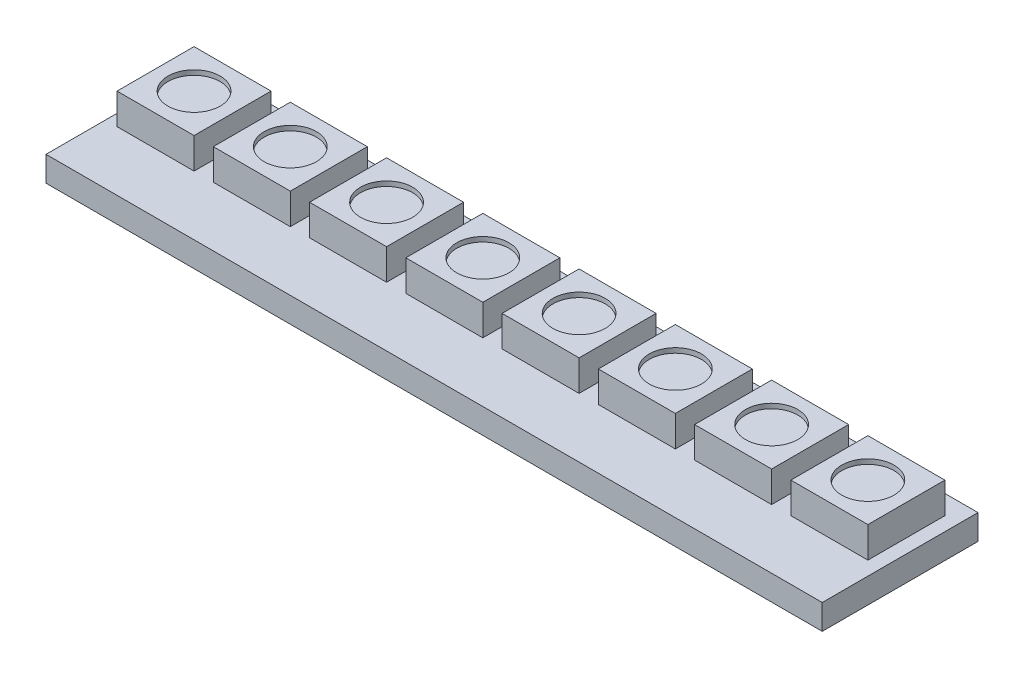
ISO-10303-21;
HEADER;
FILE_DESCRIPTION(('STEP AP214'),'2;1');
FILE_NAME('part.step','',(''),(''),'','','');
FILE_SCHEMA(('AUTOMOTIVE_DESIGN { 1 0 10303 214 1 1 1 1 }'));
ENDSEC;
DATA;
#1=APPLICATION_CONTEXT('core data for automotive mechanical design processes');
#2=APPLICATION_PROTOCOL_DEFINITION('international standard','automotive_design',2000,#1);
#3=PRODUCT_CONTEXT('',#1,'mechanical');
#4=PRODUCT('Part','Part','',(#3));
#5=PRODUCT_RELATED_PRODUCT_CATEGORY('part','',(#4));
#6=PRODUCT_DEFINITION_FORMATION('','',#4);
#7=PRODUCT_DEFINITION_CONTEXT('part definition',#1,'design');
#8=PRODUCT_DEFINITION('design','',#6,#7);
#9=PRODUCT_DEFINITION_SHAPE('','',#8);
#10=(LENGTH_UNIT() NAMED_UNIT(*) SI_UNIT(.MILLI.,.METRE.));
#11=(NAMED_UNIT(*) PLANE_ANGLE_UNIT() SI_UNIT($,.RADIAN.));
#12=(NAMED_UNIT(*) SI_UNIT($,.STERADIAN.) SOLID_ANGLE_UNIT());
#13=UNCERTAINTY_MEASURE_WITH_UNIT(LENGTH_MEASURE(1.E-05),#10,'distance_accuracy_value','');
#14=(GEOMETRIC_REPRESENTATION_CONTEXT(3) GLOBAL_UNCERTAINTY_ASSIGNED_CONTEXT((#13)) GLOBAL_UNIT_ASSIGNED_CONTEXT((#10,
#11,#12)) REPRESENTATION_CONTEXT('',''));
#15=CARTESIAN_POINT('',(0.,0.,0.));
#16=DIRECTION('',(0.,0.,1.));
#17=DIRECTION('',(1.,0.,0.));
#18=AXIS2_PLACEMENT_3D('',#15,#16,#17);
#19=CARTESIAN_POINT('',(0.,1.651,0.));
#20=DIRECTION('',(0.,1.,0.));
#21=DIRECTION('',(0.,0.,1.));
#22=AXIS2_PLACEMENT_3D('',#19,#20,#21);
#23=PLANE('',#22);
#24=DIRECTION('',(-1.,0.,0.));
#25=VECTOR('',#24,1.);
#26=CARTESIAN_POINT('',(-24.8412,1.651,-3.86715));
#27=LINE('',#26,#25);
#28=CARTESIAN_POINT('',(-19.7612,1.651,-3.86715));
#29=VERTEX_POINT('',#28);
#30=CARTESIAN_POINT('',(-24.8412,1.651,-3.86715));
#31=VERTEX_POINT('',#30);
#32=EDGE_CURVE('E325',#29,#31,#27,.T.);
#33=ORIENTED_EDGE('',*,*,#32,.F.);
#34=DIRECTION('',(0.,0.,-1.));
#35=VECTOR('',#34,1.);
#36=CARTESIAN_POINT('',(-19.7612,1.651,1.21284999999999));
#37=LINE('',#36,#35);
#38=CARTESIAN_POINT('',(-19.7612,1.651,1.21284999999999));
#39=VERTEX_POINT('',#38);
#40=EDGE_CURVE('E309',#39,#29,#37,.T.);
#41=ORIENTED_EDGE('',*,*,#40,.F.);
#42=DIRECTION('',(1.,0.,0.));
#43=VECTOR('',#42,1.);
#44=CARTESIAN_POINT('',(-24.8412,1.651,1.21284999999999));
#45=LINE('',#44,#43);
#46=CARTESIAN_POINT('',(-24.8412,1.651,1.21284999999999));
#47=VERTEX_POINT('',#46);
#48=EDGE_CURVE('E316',#47,#39,#45,.T.);
#49=ORIENTED_EDGE('',*,*,#48,.F.);
#50=DIRECTION('',(0.,0.,1.));
#51=VECTOR('',#50,1.);
#52=CARTESIAN_POINT('',(-24.8412,1.651,1.21284999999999));
#53=LINE('',#52,#51);
#54=EDGE_CURVE('E327',#31,#47,#53,.T.);
#55=ORIENTED_EDGE('',*,*,#54,.F.);
#56=EDGE_LOOP('',(#33,#41,#49,#55));
#57=FACE_BOUND('',#56,.T.);
#58=DIRECTION('',(0.,0.,1.));
#59=VECTOR('',#58,1.);
#60=CARTESIAN_POINT('',(-25.6032,1.651,5.13715));
#61=LINE('',#60,#59);
#62=CARTESIAN_POINT('',(-25.6032,1.651,-5.13715));
#63=VERTEX_POINT('',#62);
#64=CARTESIAN_POINT('',(-25.6032,1.651,5.13715));
#65=VERTEX_POINT('',#64);
#66=EDGE_CURVE('E341',#63,#65,#61,.T.);
#67=ORIENTED_EDGE('',*,*,#66,.T.);
#68=DIRECTION('',(1.,0.,0.));
#69=VECTOR('',#68,1.);
#70=CARTESIAN_POINT('',(25.6032,1.651,5.13715));
#71=LINE('',#70,#69);
#72=CARTESIAN_POINT('',(25.6032,1.651,5.13715));
#73=VERTEX_POINT('',#72);
#74=EDGE_CURVE('E344',#65,#73,#71,.T.);
#75=ORIENTED_EDGE('',*,*,#74,.T.);
#76=DIRECTION('',(0.,0.,-1.));
#77=VECTOR('',#76,1.);
#78=CARTESIAN_POINT('',(25.6032,1.651,5.13715));
#79=LINE('',#78,#77);
#80=CARTESIAN_POINT('',(25.6032,1.651,-5.13715));
#81=VERTEX_POINT('',#80);
#82=EDGE_CURVE('E347',#73,#81,#79,.T.);
#83=ORIENTED_EDGE('',*,*,#82,.T.);
#84=DIRECTION('',(-1.,0.,0.));
#85=VECTOR('',#84,1.);
#86=CARTESIAN_POINT('',(25.6032,1.651,-5.13715));
#87=LINE('',#86,#85);
#88=EDGE_CURVE('E349',#81,#63,#87,.T.);
#89=ORIENTED_EDGE('',*,*,#88,.T.);
#90=EDGE_LOOP('',(#67,#75,#83,#89));
#91=FACE_BOUND('',#90,.T.);
#92=DIRECTION('',(-1.,0.,0.));
#93=VECTOR('',#92,1.);
#94=CARTESIAN_POINT('',(-18.4912,1.651,-3.86715));
#95=LINE('',#94,#93);
#96=CARTESIAN_POINT('',(-13.4112,1.651,-3.86715));
#97=VERTEX_POINT('',#96);
#98=CARTESIAN_POINT('',(-18.4912,1.651,-3.86715));
#99=VERTEX_POINT('',#98);
#100=EDGE_CURVE('E299',#97,#99,#95,.T.);
#101=ORIENTED_EDGE('',*,*,#100,.F.);
#102=DIRECTION('',(0.,0.,-1.));
#103=VECTOR('',#102,1.);
#104=CARTESIAN_POINT('',(-13.4112,1.651,1.21284999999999));
#105=LINE('',#104,#103);
#106=CARTESIAN_POINT('',(-13.4112,1.651,1.21284999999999));
#107=VERTEX_POINT('',#106);
#108=EDGE_CURVE('E297',#107,#97,#105,.T.);
#109=ORIENTED_EDGE('',*,*,#108,.F.);
#110=DIRECTION('',(1.,0.,0.));
#111=VECTOR('',#110,1.);
#112=CARTESIAN_POINT('',(-18.4912,1.651,1.21284999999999));
#113=LINE('',#112,#111);
#114=CARTESIAN_POINT('',(-18.4912,1.651,1.21284999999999));
#115=VERTEX_POINT('',#114);
#116=EDGE_CURVE('E1340',#115,#107,#113,.T.);
#117=ORIENTED_EDGE('',*,*,#116,.F.);
#118=DIRECTION('',(0.,0.,1.));
#119=VECTOR('',#118,1.);
#120=CARTESIAN_POINT('',(-18.4912,1.651,1.21284999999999));
#121=LINE('',#120,#119);
#122=EDGE_CURVE('E1334',#99,#115,#121,.T.);
#123=ORIENTED_EDGE('',*,*,#122,.F.);
#124=EDGE_LOOP('',(#101,#109,#117,#123));
#125=FACE_BOUND('',#124,.T.);
#126=DIRECTION('',(0.,0.,-1.));
#127=VECTOR('',#126,1.);
#128=CARTESIAN_POINT('',(-7.0612,1.651,1.21284999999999));
#129=LINE('',#128,#127);
#130=CARTESIAN_POINT('',(-7.0612,1.651,1.21284999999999));
#131=VERTEX_POINT('',#130);
#132=CARTESIAN_POINT('',(-7.0612,1.651,-3.86715));
#133=VERTEX_POINT('',#132);
#134=EDGE_CURVE('E370',#131,#133,#129,.T.);
#135=ORIENTED_EDGE('',*,*,#134,.F.);
#136=DIRECTION('',(1.,0.,0.));
#137=VECTOR('',#136,1.);
#138=CARTESIAN_POINT('',(-12.1412,1.651,1.21284999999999));
#139=LINE('',#138,#137);
#140=CARTESIAN_POINT('',(-12.1412,1.651,1.21284999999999));
#141=VERTEX_POINT('',#140);
#142=EDGE_CURVE('E372',#141,#131,#139,.T.);
#143=ORIENTED_EDGE('',*,*,#142,.F.);
#144=DIRECTION('',(0.,0.,1.));
#145=VECTOR('',#144,1.);
#146=CARTESIAN_POINT('',(-12.1412,1.651,1.21284999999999));
#147=LINE('',#146,#145);
#148=CARTESIAN_POINT('',(-12.1412,1.651,-3.86715));
#149=VERTEX_POINT('',#148);
#150=EDGE_CURVE('E375',#149,#141,#147,.T.);
#151=ORIENTED_EDGE('',*,*,#150,.F.);
#152=DIRECTION('',(-1.,0.,0.));
#153=VECTOR('',#152,1.);
#154=CARTESIAN_POINT('',(-12.1412,1.651,-3.86715));
#155=LINE('',#154,#153);
#156=EDGE_CURVE('E378',#133,#149,#155,.T.);
#157=ORIENTED_EDGE('',*,*,#156,.F.);
#158=EDGE_LOOP('',(#135,#143,#151,#157));
#159=FACE_BOUND('',#158,.T.);
#160=DIRECTION('',(0.,0.,-1.));
#161=VECTOR('',#160,1.);
#162=CARTESIAN_POINT('',(-0.711200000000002,1.651,1.21284999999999));
#163=LINE('',#162,#161);
#164=CARTESIAN_POINT('',(-0.711200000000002,1.651,1.21284999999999));
#165=VERTEX_POINT('',#164);
#166=CARTESIAN_POINT('',(-0.711200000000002,1.651,-3.86715));
#167=VERTEX_POINT('',#166);
#168=EDGE_CURVE('E411',#165,#167,#163,.T.);
#169=ORIENTED_EDGE('',*,*,#168,.F.);
#170=DIRECTION('',(1.,0.,0.));
#171=VECTOR('',#170,1.);
#172=CARTESIAN_POINT('',(-5.7912,1.651,1.21284999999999));
#173=LINE('',#172,#171);
#174=CARTESIAN_POINT('',(-5.7912,1.651,1.21284999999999));
#175=VERTEX_POINT('',#174);
#176=EDGE_CURVE('E413',#175,#165,#173,.T.);
#177=ORIENTED_EDGE('',*,*,#176,.F.);
#178=DIRECTION('',(0.,0.,1.));
#179=VECTOR('',#178,1.);
#180=CARTESIAN_POINT('',(-5.7912,1.651,1.21284999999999));
#181=LINE('',#180,#179);
#182=CARTESIAN_POINT('',(-5.7912,1.651,-3.86715));
#183=VERTEX_POINT('',#182);
#184=EDGE_CURVE('E416',#183,#175,#181,.T.);
#185=ORIENTED_EDGE('',*,*,#184,.F.);
#186=DIRECTION('',(-1.,0.,0.));
#187=VECTOR('',#186,1.);
#188=CARTESIAN_POINT('',(-5.7912,1.651,-3.86715));
#189=LINE('',#188,#187);
#190=EDGE_CURVE('E419',#167,#183,#189,.T.);
#191=ORIENTED_EDGE('',*,*,#190,.F.);
#192=EDGE_LOOP('',(#169,#177,#185,#191));
#193=FACE_BOUND('',#192,.T.);
#194=DIRECTION('',(0.,0.,-1.));
#195=VECTOR('',#194,1.);
#196=CARTESIAN_POINT('',(5.6388,1.651,1.21284999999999));
#197=LINE('',#196,#195);
#198=CARTESIAN_POINT('',(5.6388,1.651,1.21284999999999));
#199=VERTEX_POINT('',#198);
#200=CARTESIAN_POINT('',(5.6388,1.651,-3.86715));
#201=VERTEX_POINT('',#200);
#202=EDGE_CURVE('E452',#199,#201,#197,.T.);
#203=ORIENTED_EDGE('',*,*,#202,.F.);
#204=DIRECTION('',(1.,0.,0.));
#205=VECTOR('',#204,1.);
#206=CARTESIAN_POINT('',(0.558799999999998,1.651,1.21284999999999));
#207=LINE('',#206,#205);
#208=CARTESIAN_POINT('',(0.558799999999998,1.651,1.21284999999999));
#209=VERTEX_POINT('',#208);
#210=EDGE_CURVE('E454',#209,#199,#207,.T.);
#211=ORIENTED_EDGE('',*,*,#210,.F.);
#212=DIRECTION('',(0.,0.,1.));
#213=VECTOR('',#212,1.);
#214=CARTESIAN_POINT('',(0.558799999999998,1.651,1.21284999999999));
#215=LINE('',#214,#213);
#216=CARTESIAN_POINT('',(0.558799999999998,1.651,-3.86715));
#217=VERTEX_POINT('',#216);
#218=EDGE_CURVE('E457',#217,#209,#215,.T.);
#219=ORIENTED_EDGE('',*,*,#218,.F.);
#220=DIRECTION('',(-1.,0.,0.));
#221=VECTOR('',#220,1.);
#222=CARTESIAN_POINT('',(0.558799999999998,1.651,-3.86715));
#223=LINE('',#222,#221);
#224=EDGE_CURVE('E460',#201,#217,#223,.T.);
#225=ORIENTED_EDGE('',*,*,#224,.F.);
#226=EDGE_LOOP('',(#203,#211,#219,#225));
#227=FACE_BOUND('',#226,.T.);
#228=DIRECTION('',(0.,0.,-1.));
#229=VECTOR('',#228,1.);
#230=CARTESIAN_POINT('',(11.9888,1.651,1.21284999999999));
#231=LINE('',#230,#229);
#232=CARTESIAN_POINT('',(11.9888,1.651,1.21284999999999));
#233=VERTEX_POINT('',#232);
#234=CARTESIAN_POINT('',(11.9888,1.651,-3.86715000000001));
#235=VERTEX_POINT('',#234);
#236=EDGE_CURVE('E493',#233,#235,#231,.T.);
#237=ORIENTED_EDGE('',*,*,#236,.F.);
#238=DIRECTION('',(1.,0.,0.));
#239=VECTOR('',#238,1.);
#240=CARTESIAN_POINT('',(6.9088,1.651,1.21284999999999));
#241=LINE('',#240,#239);
#242=CARTESIAN_POINT('',(6.9088,1.651,1.21284999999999));
#243=VERTEX_POINT('',#242);
#244=EDGE_CURVE('E495',#243,#233,#241,.T.);
#245=ORIENTED_EDGE('',*,*,#244,.F.);
#246=DIRECTION('',(0.,0.,1.));
#247=VECTOR('',#246,1.);
#248=CARTESIAN_POINT('',(6.9088,1.651,1.21284999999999));
#249=LINE('',#248,#247);
#250=CARTESIAN_POINT('',(6.9088,1.651,-3.86715000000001));
#251=VERTEX_POINT('',#250);
#252=EDGE_CURVE('E498',#251,#243,#249,.T.);
#253=ORIENTED_EDGE('',*,*,#252,.F.);
#254=DIRECTION('',(-1.,0.,0.));
#255=VECTOR('',#254,1.);
#256=CARTESIAN_POINT('',(6.9088,1.651,-3.86715000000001));
#257=LINE('',#256,#255);
#258=EDGE_CURVE('E501',#235,#251,#257,.T.);
#259=ORIENTED_EDGE('',*,*,#258,.F.);
#260=EDGE_LOOP('',(#237,#245,#253,#259));
#261=FACE_BOUND('',#260,.T.);
#262=DIRECTION('',(0.,0.,-1.));
#263=VECTOR('',#262,1.);
#264=CARTESIAN_POINT('',(18.3388,1.651,1.21284999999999));
#265=LINE('',#264,#263);
#266=CARTESIAN_POINT('',(18.3388,1.651,1.21284999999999));
#267=VERTEX_POINT('',#266);
#268=CARTESIAN_POINT('',(18.3388,1.651,-3.86715000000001));
#269=VERTEX_POINT('',#268);
#270=EDGE_CURVE('E534',#267,#269,#265,.T.);
#271=ORIENTED_EDGE('',*,*,#270,.F.);
#272=DIRECTION('',(1.,0.,0.));
#273=VECTOR('',#272,1.);
#274=CARTESIAN_POINT('',(13.2588,1.651,1.21284999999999));
#275=LINE('',#274,#273);
#276=CARTESIAN_POINT('',(13.2588,1.651,1.21284999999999));
#277=VERTEX_POINT('',#276);
#278=EDGE_CURVE('E536',#277,#267,#275,.T.);
#279=ORIENTED_EDGE('',*,*,#278,.F.);
#280=DIRECTION('',(0.,0.,1.));
#281=VECTOR('',#280,1.);
#282=CARTESIAN_POINT('',(13.2588,1.651,1.21284999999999));
#283=LINE('',#282,#281);
#284=CARTESIAN_POINT('',(13.2588,1.651,-3.86715000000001));
#285=VERTEX_POINT('',#284);
#286=EDGE_CURVE('E539',#285,#277,#283,.T.);
#287=ORIENTED_EDGE('',*,*,#286,.F.);
#288=DIRECTION('',(-1.,0.,0.));
#289=VECTOR('',#288,1.);
#290=CARTESIAN_POINT('',(13.2588,1.651,-3.86715000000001));
#291=LINE('',#290,#289);
#292=EDGE_CURVE('E542',#269,#285,#291,.T.);
#293=ORIENTED_EDGE('',*,*,#292,.F.);
#294=EDGE_LOOP('',(#271,#279,#287,#293));
#295=FACE_BOUND('',#294,.T.);
#296=DIRECTION('',(0.,0.,-1.));
#297=VECTOR('',#296,1.);
#298=CARTESIAN_POINT('',(24.6888,1.651,1.21284999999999));
#299=LINE('',#298,#297);
#300=CARTESIAN_POINT('',(24.6888,1.651,1.21284999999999));
#301=VERTEX_POINT('',#300);
#302=CARTESIAN_POINT('',(24.6888,1.651,-3.86715000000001));
#303=VERTEX_POINT('',#302);
#304=EDGE_CURVE('E575',#301,#303,#299,.T.);
#305=ORIENTED_EDGE('',*,*,#304,.F.);
#306=DIRECTION('',(1.,0.,0.));
#307=VECTOR('',#306,1.);
#308=CARTESIAN_POINT('',(19.6088,1.651,1.21284999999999));
#309=LINE('',#308,#307);
#310=CARTESIAN_POINT('',(19.6088,1.651,1.21284999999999));
#311=VERTEX_POINT('',#310);
#312=EDGE_CURVE('E577',#311,#301,#309,.T.);
#313=ORIENTED_EDGE('',*,*,#312,.F.);
#314=DIRECTION('',(0.,0.,1.));
#315=VECTOR('',#314,1.);
#316=CARTESIAN_POINT('',(19.6088,1.651,1.21284999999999));
#317=LINE('',#316,#315);
#318=CARTESIAN_POINT('',(19.6088,1.651,-3.86715000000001));
#319=VERTEX_POINT('',#318);
#320=EDGE_CURVE('E580',#319,#311,#317,.T.);
#321=ORIENTED_EDGE('',*,*,#320,.F.);
#322=DIRECTION('',(-1.,0.,0.));
#323=VECTOR('',#322,1.);
#324=CARTESIAN_POINT('',(19.6088,1.651,-3.86715000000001));
#325=LINE('',#324,#323);
#326=EDGE_CURVE('E582',#303,#319,#325,.T.);
#327=ORIENTED_EDGE('',*,*,#326,.F.);
#328=EDGE_LOOP('',(#305,#313,#321,#327));
#329=FACE_BOUND('',#328,.T.);
#330=ADVANCED_FACE('F37',(#57,#91,#125,#159,#193,#227,#261,#295,#329),#23,.T.);
#331=CARTESIAN_POINT('',(-25.6032,1.651,5.13715));
#332=DIRECTION('',(1.,0.,0.));
#333=DIRECTION('',(0.,0.,-1.));
#334=AXIS2_PLACEMENT_3D('',#331,#332,#333);
#335=PLANE('',#334);
#336=DIRECTION('',(0.,0.,1.));
#337=VECTOR('',#336,1.);
#338=CARTESIAN_POINT('',(-25.6032,0.,5.13715));
#339=LINE('',#338,#337);
#340=CARTESIAN_POINT('',(-25.6032,0.,-5.13715));
#341=VERTEX_POINT('',#340);
#342=CARTESIAN_POINT('',(-25.6032,0.,5.13715));
#343=VERTEX_POINT('',#342);
#344=EDGE_CURVE('E340',#341,#343,#339,.T.);
#345=ORIENTED_EDGE('',*,*,#344,.T.);
#346=DIRECTION('',(0.,-1.,0.));
#347=VECTOR('',#346,1.);
#348=CARTESIAN_POINT('',(-25.6032,1.651,5.13715));
#349=LINE('',#348,#347);
#350=EDGE_CURVE('E367',#65,#343,#349,.T.);
#351=ORIENTED_EDGE('',*,*,#350,.F.);
#352=ORIENTED_EDGE('',*,*,#66,.F.);
#353=DIRECTION('',(0.,-1.,0.));
#354=VECTOR('',#353,1.);
#355=CARTESIAN_POINT('',(-25.6032,1.651,-5.13715));
#356=LINE('',#355,#354);
#357=EDGE_CURVE('E351',#63,#341,#356,.T.);
#358=ORIENTED_EDGE('',*,*,#357,.T.);
#359=EDGE_LOOP('',(#345,#351,#352,#358));
#360=FACE_BOUND('',#359,.T.);
#361=ADVANCED_FACE('F627',(#360),#335,.F.);
#362=CARTESIAN_POINT('',(25.6032,1.651,5.13715));
#363=DIRECTION('',(0.,0.,-1.));
#364=DIRECTION('',(-1.,0.,0.));
#365=AXIS2_PLACEMENT_3D('',#362,#363,#364);
#366=PLANE('',#365);
#367=DIRECTION('',(1.,0.,0.));
#368=VECTOR('',#367,1.);
#369=CARTESIAN_POINT('',(25.6032,0.,5.13715));
#370=LINE('',#369,#368);
#371=CARTESIAN_POINT('',(25.6032,0.,5.13715));
#372=VERTEX_POINT('',#371);
#373=EDGE_CURVE('E354',#343,#372,#370,.T.);
#374=ORIENTED_EDGE('',*,*,#373,.T.);
#375=DIRECTION('',(0.,-1.,0.));
#376=VECTOR('',#375,1.);
#377=CARTESIAN_POINT('',(25.6032,1.651,5.13715));
#378=LINE('',#377,#376);
#379=EDGE_CURVE('E364',#73,#372,#378,.T.);
#380=ORIENTED_EDGE('',*,*,#379,.F.);
#381=ORIENTED_EDGE('',*,*,#74,.F.);
#382=ORIENTED_EDGE('',*,*,#350,.T.);
#383=EDGE_LOOP('',(#374,#380,#381,#382));
#384=FACE_BOUND('',#383,.T.);
#385=ADVANCED_FACE('F633',(#384),#366,.F.);
#386=CARTESIAN_POINT('',(25.6032,1.651,5.13715));
#387=DIRECTION('',(-1.,0.,0.));
#388=DIRECTION('',(0.,0.,1.));
#389=AXIS2_PLACEMENT_3D('',#386,#387,#388);
#390=PLANE('',#389);
#391=DIRECTION('',(0.,0.,-1.));
#392=VECTOR('',#391,1.);
#393=CARTESIAN_POINT('',(25.6032,0.,5.13715));
#394=LINE('',#393,#392);
#395=CARTESIAN_POINT('',(25.6032,0.,-5.13715));
#396=VERTEX_POINT('',#395);
#397=EDGE_CURVE('E356',#372,#396,#394,.T.);
#398=ORIENTED_EDGE('',*,*,#397,.T.);
#399=DIRECTION('',(0.,-1.,0.));
#400=VECTOR('',#399,1.);
#401=CARTESIAN_POINT('',(25.6032,1.651,-5.13715));
#402=LINE('',#401,#400);
#403=EDGE_CURVE('E361',#81,#396,#402,.T.);
#404=ORIENTED_EDGE('',*,*,#403,.F.);
#405=ORIENTED_EDGE('',*,*,#82,.F.);
#406=ORIENTED_EDGE('',*,*,#379,.T.);
#407=EDGE_LOOP('',(#398,#404,#405,#406));
#408=FACE_BOUND('',#407,.T.);
#409=ADVANCED_FACE('F649',(#408),#390,.F.);
#410=CARTESIAN_POINT('',(25.6032,1.651,-5.13715));
#411=DIRECTION('',(0.,0.,1.));
#412=DIRECTION('',(1.,0.,0.));
#413=AXIS2_PLACEMENT_3D('',#410,#411,#412);
#414=PLANE('',#413);
#415=DIRECTION('',(-1.,0.,0.));
#416=VECTOR('',#415,1.);
#417=CARTESIAN_POINT('',(25.6032,0.,-5.13715));
#418=LINE('',#417,#416);
#419=EDGE_CURVE('E345',#396,#341,#418,.T.);
#420=ORIENTED_EDGE('',*,*,#419,.T.);
#421=ORIENTED_EDGE('',*,*,#357,.F.);
#422=ORIENTED_EDGE('',*,*,#88,.F.);
#423=ORIENTED_EDGE('',*,*,#403,.T.);
#424=EDGE_LOOP('',(#420,#421,#422,#423));
#425=FACE_BOUND('',#424,.T.);
#426=ADVANCED_FACE('F645',(#425),#414,.F.);
#427=CARTESIAN_POINT('',(0.,0.,0.));
#428=DIRECTION('',(0.,1.,0.));
#429=DIRECTION('',(0.,0.,1.));
#430=AXIS2_PLACEMENT_3D('',#427,#428,#429);
#431=PLANE('',#430);
#432=ORIENTED_EDGE('',*,*,#344,.F.);
#433=ORIENTED_EDGE('',*,*,#419,.F.);
#434=ORIENTED_EDGE('',*,*,#397,.F.);
#435=ORIENTED_EDGE('',*,*,#373,.F.);
#436=EDGE_LOOP('',(#432,#433,#434,#435));
#437=FACE_BOUND('',#436,.T.);
#438=ADVANCED_FACE('F642',(#437),#431,.F.);
#439=CARTESIAN_POINT('',(-19.7612,3.683,1.21284999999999));
#440=DIRECTION('',(-1.,0.,0.));
#441=DIRECTION('',(0.,0.,1.));
#442=AXIS2_PLACEMENT_3D('',#439,#440,#441);
#443=PLANE('',#442);
#444=ORIENTED_EDGE('',*,*,#40,.T.);
#445=DIRECTION('',(0.,-1.,0.));
#446=VECTOR('',#445,1.);
#447=CARTESIAN_POINT('',(-19.7612,3.683,-3.86715));
#448=LINE('',#447,#446);
#449=CARTESIAN_POINT('',(-19.7612,3.683,-3.86715));
#450=VERTEX_POINT('',#449);
#451=EDGE_CURVE('E338',#450,#29,#448,.T.);
#452=ORIENTED_EDGE('',*,*,#451,.F.);
#453=DIRECTION('',(0.,0.,-1.));
#454=VECTOR('',#453,1.);
#455=CARTESIAN_POINT('',(-19.7612,3.683,1.21284999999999));
#456=LINE('',#455,#454);
#457=CARTESIAN_POINT('',(-19.7612,3.683,1.21284999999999));
#458=VERTEX_POINT('',#457);
#459=EDGE_CURVE('E312',#458,#450,#456,.T.);
#460=ORIENTED_EDGE('',*,*,#459,.F.);
#461=DIRECTION('',(0.,-1.,0.));
#462=VECTOR('',#461,1.);
#463=CARTESIAN_POINT('',(-19.7612,3.683,1.21284999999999));
#464=LINE('',#463,#462);
#465=EDGE_CURVE('E322',#458,#39,#464,.T.);
#466=ORIENTED_EDGE('',*,*,#465,.T.);
#467=EDGE_LOOP('',(#444,#452,#460,#466));
#468=FACE_BOUND('',#467,.T.);
#469=ADVANCED_FACE('F640',(#468),#443,.F.);
#470=CARTESIAN_POINT('',(-24.8412,3.683,-3.86715));
#471=DIRECTION('',(0.,0.,1.));
#472=DIRECTION('',(1.,0.,0.));
#473=AXIS2_PLACEMENT_3D('',#470,#471,#472);
#474=PLANE('',#473);
#475=ORIENTED_EDGE('',*,*,#32,.T.);
#476=DIRECTION('',(0.,-1.,0.));
#477=VECTOR('',#476,1.);
#478=CARTESIAN_POINT('',(-24.8412,3.683,-3.86715));
#479=LINE('',#478,#477);
#480=CARTESIAN_POINT('',(-24.8412,3.683,-3.86715));
#481=VERTEX_POINT('',#480);
#482=EDGE_CURVE('E335',#481,#31,#479,.T.);
#483=ORIENTED_EDGE('',*,*,#482,.F.);
#484=DIRECTION('',(-1.,0.,0.));
#485=VECTOR('',#484,1.);
#486=CARTESIAN_POINT('',(-24.8412,3.683,-3.86715));
#487=LINE('',#486,#485);
#488=EDGE_CURVE('E315',#450,#481,#487,.T.);
#489=ORIENTED_EDGE('',*,*,#488,.F.);
#490=ORIENTED_EDGE('',*,*,#451,.T.);
#491=EDGE_LOOP('',(#475,#483,#489,#490));
#492=FACE_BOUND('',#491,.T.);
#493=ADVANCED_FACE('F1174',(#492),#474,.F.);
#494=CARTESIAN_POINT('',(-24.8412,3.683,1.21284999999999));
#495=DIRECTION('',(1.,0.,0.));
#496=DIRECTION('',(0.,0.,-1.));
#497=AXIS2_PLACEMENT_3D('',#494,#495,#496);
#498=PLANE('',#497);
#499=ORIENTED_EDGE('',*,*,#54,.T.);
#500=DIRECTION('',(0.,-1.,0.));
#501=VECTOR('',#500,1.);
#502=CARTESIAN_POINT('',(-24.8412,3.683,1.21284999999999));
#503=LINE('',#502,#501);
#504=CARTESIAN_POINT('',(-24.8412,3.683,1.21284999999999));
#505=VERTEX_POINT('',#504);
#506=EDGE_CURVE('E333',#505,#47,#503,.T.);
#507=ORIENTED_EDGE('',*,*,#506,.F.);
#508=DIRECTION('',(0.,0.,1.));
#509=VECTOR('',#508,1.);
#510=CARTESIAN_POINT('',(-24.8412,3.683,1.21284999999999));
#511=LINE('',#510,#509);
#512=EDGE_CURVE('E318',#481,#505,#511,.T.);
#513=ORIENTED_EDGE('',*,*,#512,.F.);
#514=ORIENTED_EDGE('',*,*,#482,.T.);
#515=EDGE_LOOP('',(#499,#507,#513,#514));
#516=FACE_BOUND('',#515,.T.);
#517=ADVANCED_FACE('F1165',(#516),#498,.F.);
#518=CARTESIAN_POINT('',(-24.8412,3.683,1.21284999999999));
#519=DIRECTION('',(0.,0.,-1.));
#520=DIRECTION('',(-1.,0.,0.));
#521=AXIS2_PLACEMENT_3D('',#518,#519,#520);
#522=PLANE('',#521);
#523=ORIENTED_EDGE('',*,*,#48,.T.);
#524=ORIENTED_EDGE('',*,*,#465,.F.);
#525=DIRECTION('',(1.,0.,0.));
#526=VECTOR('',#525,1.);
#527=CARTESIAN_POINT('',(-24.8412,3.683,1.21284999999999));
#528=LINE('',#527,#526);
#529=EDGE_CURVE('E320',#505,#458,#528,.T.);
#530=ORIENTED_EDGE('',*,*,#529,.F.);
#531=ORIENTED_EDGE('',*,*,#506,.T.);
#532=EDGE_LOOP('',(#523,#524,#530,#531));
#533=FACE_BOUND('',#532,.T.);
#534=ADVANCED_FACE('F1156',(#533),#522,.F.);
#535=CARTESIAN_POINT('',(0.,3.683,0.));
#536=DIRECTION('',(0.,-1.,0.));
#537=DIRECTION('',(0.,0.,-1.));
#538=AXIS2_PLACEMENT_3D('',#535,#536,#537);
#539=PLANE('',#538);
#540=CARTESIAN_POINT('',(-22.3012,3.683,-1.32715));
#541=DIRECTION('',(0.,1.,0.));
#542=DIRECTION('',(0.,0.,1.));
#543=AXIS2_PLACEMENT_3D('',#540,#541,#542);
#544=CIRCLE('',#543,1.72181726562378);
#545=CARTESIAN_POINT('',(-22.3012,3.683,0.394667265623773));
#546=VERTEX_POINT('',#545);
#547=EDGE_CURVE('E301',#546,#546,#544,.T.);
#548=ORIENTED_EDGE('',*,*,#547,.F.);
#549=EDGE_LOOP('',(#548));
#550=FACE_BOUND('',#549,.T.);
#551=ORIENTED_EDGE('',*,*,#459,.T.);
#552=ORIENTED_EDGE('',*,*,#488,.T.);
#553=ORIENTED_EDGE('',*,*,#512,.T.);
#554=ORIENTED_EDGE('',*,*,#529,.T.);
#555=EDGE_LOOP('',(#551,#552,#553,#554));
#556=FACE_BOUND('',#555,.T.);
#557=ADVANCED_FACE('F1147',(#550,#556),#539,.F.);
#558=CARTESIAN_POINT('',(-22.3012,3.3655,-1.32715));
#559=DIRECTION('',(0.,1.,0.));
#560=DIRECTION('',(0.,0.,1.));
#561=AXIS2_PLACEMENT_3D('',#558,#559,#560);
#562=CYLINDRICAL_SURFACE('',#561,1.72181726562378);
#563=CARTESIAN_POINT('',(-22.3012,3.3655,-1.32715));
#564=DIRECTION('',(0.,1.,0.));
#565=DIRECTION('',(0.,0.,1.));
#566=AXIS2_PLACEMENT_3D('',#563,#564,#565);
#567=CIRCLE('',#566,1.72181726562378);
#568=CARTESIAN_POINT('',(-22.3012,3.3655,0.394667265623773));
#569=VERTEX_POINT('',#568);
#570=EDGE_CURVE('E306',#569,#569,#567,.T.);
#571=ORIENTED_EDGE('',*,*,#570,.F.);
#572=EDGE_LOOP('',(#571));
#573=FACE_BOUND('',#572,.T.);
#574=ORIENTED_EDGE('',*,*,#547,.T.);
#575=EDGE_LOOP('',(#574));
#576=FACE_BOUND('',#575,.T.);
#577=ADVANCED_FACE('F1138',(#573,#576),#562,.F.);
#578=CARTESIAN_POINT('',(-22.3012,3.3655,-1.32715));
#579=DIRECTION('',(0.,1.,0.));
#580=DIRECTION('',(0.,0.,1.));
#581=AXIS2_PLACEMENT_3D('',#578,#579,#580);
#582=PLANE('',#581);
#583=ORIENTED_EDGE('',*,*,#570,.T.);
#584=EDGE_LOOP('',(#583));
#585=FACE_BOUND('',#584,.T.);
#586=ADVANCED_FACE('F1125',(#585),#582,.T.);
#587=CARTESIAN_POINT('',(-13.4112,3.683,1.21284999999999));
#588=DIRECTION('',(-1.,0.,0.));
#589=DIRECTION('',(0.,0.,1.));
#590=AXIS2_PLACEMENT_3D('',#587,#588,#589);
#591=PLANE('',#590);
#592=ORIENTED_EDGE('',*,*,#108,.T.);
#593=DIRECTION('',(0.,-1.,0.));
#594=VECTOR('',#593,1.);
#595=CARTESIAN_POINT('',(-13.4112,3.683,-3.86715));
#596=LINE('',#595,#594);
#597=CARTESIAN_POINT('',(-13.4112,3.683,-3.86715));
#598=VERTEX_POINT('',#597);
#599=EDGE_CURVE('E290',#598,#97,#596,.T.);
#600=ORIENTED_EDGE('',*,*,#599,.F.);
#601=DIRECTION('',(0.,0.,-1.));
#602=VECTOR('',#601,1.);
#603=CARTESIAN_POINT('',(-13.4112,3.683,1.21284999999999));
#604=LINE('',#603,#602);
#605=CARTESIAN_POINT('',(-13.4112,3.683,1.21284999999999));
#606=VERTEX_POINT('',#605);
#607=EDGE_CURVE('E273',#606,#598,#604,.T.);
#608=ORIENTED_EDGE('',*,*,#607,.F.);
#609=DIRECTION('',(0.,-1.,0.));
#610=VECTOR('',#609,1.);
#611=CARTESIAN_POINT('',(-13.4112,3.683,1.21284999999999));
#612=LINE('',#611,#610);
#613=EDGE_CURVE('E1341',#606,#107,#612,.T.);
#614=ORIENTED_EDGE('',*,*,#613,.T.);
#615=EDGE_LOOP('',(#592,#600,#608,#614));
#616=FACE_BOUND('',#615,.T.);
#617=ADVANCED_FACE('F295',(#616),#591,.F.);
#618=CARTESIAN_POINT('',(-18.4912,3.683,-3.86715));
#619=DIRECTION('',(0.,0.,1.));
#620=DIRECTION('',(1.,0.,0.));
#621=AXIS2_PLACEMENT_3D('',#618,#619,#620);
#622=PLANE('',#621);
#623=ORIENTED_EDGE('',*,*,#100,.T.);
#624=DIRECTION('',(0.,-1.,0.));
#625=VECTOR('',#624,1.);
#626=CARTESIAN_POINT('',(-18.4912,3.683,-3.86715));
#627=LINE('',#626,#625);
#628=CARTESIAN_POINT('',(-18.4912,3.683,-3.86715));
#629=VERTEX_POINT('',#628);
#630=EDGE_CURVE('E292',#629,#99,#627,.T.);
#631=ORIENTED_EDGE('',*,*,#630,.F.);
#632=DIRECTION('',(-1.,0.,0.));
#633=VECTOR('',#632,1.);
#634=CARTESIAN_POINT('',(-18.4912,3.683,-3.86715));
#635=LINE('',#634,#633);
#636=EDGE_CURVE('E276',#598,#629,#635,.T.);
#637=ORIENTED_EDGE('',*,*,#636,.F.);
#638=ORIENTED_EDGE('',*,*,#599,.T.);
#639=EDGE_LOOP('',(#623,#631,#637,#638));
#640=FACE_BOUND('',#639,.T.);
#641=ADVANCED_FACE('F289',(#640),#622,.F.);
#642=CARTESIAN_POINT('',(-18.4912,3.683,1.21284999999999));
#643=DIRECTION('',(1.,0.,0.));
#644=DIRECTION('',(0.,0.,-1.));
#645=AXIS2_PLACEMENT_3D('',#642,#643,#644);
#646=PLANE('',#645);
#647=ORIENTED_EDGE('',*,*,#122,.T.);
#648=DIRECTION('',(0.,-1.,0.));
#649=VECTOR('',#648,1.);
#650=CARTESIAN_POINT('',(-18.4912,3.683,1.21284999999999));
#651=LINE('',#650,#649);
#652=CARTESIAN_POINT('',(-18.4912,3.683,1.21284999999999));
#653=VERTEX_POINT('',#652);
#654=EDGE_CURVE('E1336',#653,#115,#651,.T.);
#655=ORIENTED_EDGE('',*,*,#654,.F.);
#656=DIRECTION('',(0.,0.,1.));
#657=VECTOR('',#656,1.);
#658=CARTESIAN_POINT('',(-18.4912,3.683,1.21284999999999));
#659=LINE('',#658,#657);
#660=EDGE_CURVE('E293',#629,#653,#659,.T.);
#661=ORIENTED_EDGE('',*,*,#660,.F.);
#662=ORIENTED_EDGE('',*,*,#630,.T.);
#663=EDGE_LOOP('',(#647,#655,#661,#662));
#664=FACE_BOUND('',#663,.T.);
#665=ADVANCED_FACE('F1098',(#664),#646,.F.);
#666=CARTESIAN_POINT('',(-18.4912,3.683,1.21284999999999));
#667=DIRECTION('',(0.,0.,-1.));
#668=DIRECTION('',(-1.,0.,0.));
#669=AXIS2_PLACEMENT_3D('',#666,#667,#668);
#670=PLANE('',#669);
#671=ORIENTED_EDGE('',*,*,#116,.T.);
#672=ORIENTED_EDGE('',*,*,#613,.F.);
#673=DIRECTION('',(1.,0.,0.));
#674=VECTOR('',#673,1.);
#675=CARTESIAN_POINT('',(-18.4912,3.683,1.21284999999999));
#676=LINE('',#675,#674);
#677=EDGE_CURVE('E279',#653,#606,#676,.T.);
#678=ORIENTED_EDGE('',*,*,#677,.F.);
#679=ORIENTED_EDGE('',*,*,#654,.T.);
#680=EDGE_LOOP('',(#671,#672,#678,#679));
#681=FACE_BOUND('',#680,.T.);
#682=ADVANCED_FACE('F1088',(#681),#670,.F.);
#683=CARTESIAN_POINT('',(6.35,3.683,0.));
#684=DIRECTION('',(0.,-1.,0.));
#685=DIRECTION('',(0.,0.,-1.));
#686=AXIS2_PLACEMENT_3D('',#683,#684,#685);
#687=PLANE('',#686);
#688=CARTESIAN_POINT('',(-15.9512,3.683,-1.32715));
#689=DIRECTION('',(0.,1.,0.));
#690=DIRECTION('',(0.,0.,1.));
#691=AXIS2_PLACEMENT_3D('',#688,#689,#690);
#692=CIRCLE('',#691,1.72181726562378);
#693=CARTESIAN_POINT('',(-15.9512,3.683,0.394667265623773));
#694=VERTEX_POINT('',#693);
#695=EDGE_CURVE('E284',#694,#694,#692,.T.);
#696=ORIENTED_EDGE('',*,*,#695,.F.);
#697=EDGE_LOOP('',(#696));
#698=FACE_BOUND('',#697,.T.);
#699=ORIENTED_EDGE('',*,*,#607,.T.);
#700=ORIENTED_EDGE('',*,*,#636,.T.);
#701=ORIENTED_EDGE('',*,*,#660,.T.);
#702=ORIENTED_EDGE('',*,*,#677,.T.);
#703=EDGE_LOOP('',(#699,#700,#701,#702));
#704=FACE_BOUND('',#703,.T.);
#705=ADVANCED_FACE('F275',(#698,#704),#687,.F.);
#706=CARTESIAN_POINT('',(-15.9512,3.3655,-1.32715));
#707=DIRECTION('',(0.,1.,0.));
#708=DIRECTION('',(0.,0.,1.));
#709=AXIS2_PLACEMENT_3D('',#706,#707,#708);
#710=CYLINDRICAL_SURFACE('',#709,1.72181726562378);
#711=CARTESIAN_POINT('',(-15.9512,3.3655,-1.32715));
#712=DIRECTION('',(0.,1.,0.));
#713=DIRECTION('',(0.,0.,1.));
#714=AXIS2_PLACEMENT_3D('',#711,#712,#713);
#715=CIRCLE('',#714,1.72181726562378);
#716=CARTESIAN_POINT('',(-15.9512,3.3655,0.394667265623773));
#717=VERTEX_POINT('',#716);
#718=EDGE_CURVE('E1344',#717,#717,#715,.T.);
#719=ORIENTED_EDGE('',*,*,#718,.F.);
#720=EDGE_LOOP('',(#719));
#721=FACE_BOUND('',#720,.T.);
#722=ORIENTED_EDGE('',*,*,#695,.T.);
#723=EDGE_LOOP('',(#722));
#724=FACE_BOUND('',#723,.T.);
#725=ADVANCED_FACE('F1069',(#721,#724),#710,.F.);
#726=CARTESIAN_POINT('',(-15.9512,3.3655,-1.32715));
#727=DIRECTION('',(0.,1.,0.));
#728=DIRECTION('',(0.,0.,1.));
#729=AXIS2_PLACEMENT_3D('',#726,#727,#728);
#730=PLANE('',#729);
#731=ORIENTED_EDGE('',*,*,#718,.T.);
#732=EDGE_LOOP('',(#731));
#733=FACE_BOUND('',#732,.T.);
#734=ADVANCED_FACE('F685',(#733),#730,.T.);
#735=CARTESIAN_POINT('',(-9.6012,3.3655,-1.32715));
#736=DIRECTION('',(0.,1.,0.));
#737=DIRECTION('',(0.,0.,1.));
#738=AXIS2_PLACEMENT_3D('',#735,#736,#737);
#739=PLANE('',#738);
#740=CARTESIAN_POINT('',(-9.6012,3.3655,-1.32715));
#741=DIRECTION('',(0.,1.,0.));
#742=DIRECTION('',(0.,0.,1.));
#743=AXIS2_PLACEMENT_3D('',#740,#741,#742);
#744=CIRCLE('',#743,1.72181726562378);
#745=CARTESIAN_POINT('',(-9.6012,3.3655,0.394667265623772));
#746=VERTEX_POINT('',#745);
#747=EDGE_CURVE('E408',#746,#746,#744,.T.);
#748=ORIENTED_EDGE('',*,*,#747,.T.);
#749=EDGE_LOOP('',(#748));
#750=FACE_BOUND('',#749,.T.);
#751=ADVANCED_FACE('F681',(#750),#739,.T.);
#752=CARTESIAN_POINT('',(-9.6012,3.3655,-1.32715));
#753=DIRECTION('',(0.,1.,0.));
#754=DIRECTION('',(0.,0.,1.));
#755=AXIS2_PLACEMENT_3D('',#752,#753,#754);
#756=CYLINDRICAL_SURFACE('',#755,1.72181726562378);
#757=ORIENTED_EDGE('',*,*,#747,.F.);
#758=EDGE_LOOP('',(#757));
#759=FACE_BOUND('',#758,.T.);
#760=CARTESIAN_POINT('',(-9.6012,3.683,-1.32715));
#761=DIRECTION('',(0.,1.,0.));
#762=DIRECTION('',(0.,0.,1.));
#763=AXIS2_PLACEMENT_3D('',#760,#761,#762);
#764=CIRCLE('',#763,1.72181726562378);
#765=CARTESIAN_POINT('',(-9.6012,3.683,0.394667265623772));
#766=VERTEX_POINT('',#765);
#767=EDGE_CURVE('E405',#766,#766,#764,.T.);
#768=ORIENTED_EDGE('',*,*,#767,.T.);
#769=EDGE_LOOP('',(#768));
#770=FACE_BOUND('',#769,.T.);
#771=ADVANCED_FACE('F677',(#759,#770),#756,.F.);
#772=CARTESIAN_POINT('',(12.7,3.683,0.));
#773=DIRECTION('',(0.,-1.,0.));
#774=DIRECTION('',(0.,0.,-1.));
#775=AXIS2_PLACEMENT_3D('',#772,#773,#774);
#776=PLANE('',#775);
#777=ORIENTED_EDGE('',*,*,#767,.F.);
#778=EDGE_LOOP('',(#777));
#779=FACE_BOUND('',#778,.T.);
#780=DIRECTION('',(0.,0.,-1.));
#781=VECTOR('',#780,1.);
#782=CARTESIAN_POINT('',(-7.0612,3.683,1.21284999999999));
#783=LINE('',#782,#781);
#784=CARTESIAN_POINT('',(-7.0612,3.683,1.21284999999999));
#785=VERTEX_POINT('',#784);
#786=CARTESIAN_POINT('',(-7.0612,3.683,-3.86715));
#787=VERTEX_POINT('',#786);
#788=EDGE_CURVE('E384',#785,#787,#783,.T.);
#789=ORIENTED_EDGE('',*,*,#788,.T.);
#790=DIRECTION('',(-1.,0.,0.));
#791=VECTOR('',#790,1.);
#792=CARTESIAN_POINT('',(-12.1412,3.683,-3.86715));
#793=LINE('',#792,#791);
#794=CARTESIAN_POINT('',(-12.1412,3.683,-3.86715));
#795=VERTEX_POINT('',#794);
#796=EDGE_CURVE('E393',#787,#795,#793,.T.);
#797=ORIENTED_EDGE('',*,*,#796,.T.);
#798=DIRECTION('',(0.,0.,1.));
#799=VECTOR('',#798,1.);
#800=CARTESIAN_POINT('',(-12.1412,3.683,1.21284999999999));
#801=LINE('',#800,#799);
#802=CARTESIAN_POINT('',(-12.1412,3.683,1.21284999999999));
#803=VERTEX_POINT('',#802);
#804=EDGE_CURVE('E399',#795,#803,#801,.T.);
#805=ORIENTED_EDGE('',*,*,#804,.T.);
#806=DIRECTION('',(1.,0.,0.));
#807=VECTOR('',#806,1.);
#808=CARTESIAN_POINT('',(-12.1412,3.683,1.21284999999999));
#809=LINE('',#808,#807);
#810=EDGE_CURVE('E402',#803,#785,#809,.T.);
#811=ORIENTED_EDGE('',*,*,#810,.T.);
#812=EDGE_LOOP('',(#789,#797,#805,#811));
#813=FACE_BOUND('',#812,.T.);
#814=ADVANCED_FACE('F673',(#779,#813),#776,.F.);
#815=CARTESIAN_POINT('',(-12.1412,3.683,1.21284999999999));
#816=DIRECTION('',(0.,0.,-1.));
#817=DIRECTION('',(-1.,0.,0.));
#818=AXIS2_PLACEMENT_3D('',#815,#816,#817);
#819=PLANE('',#818);
#820=ORIENTED_EDGE('',*,*,#142,.T.);
#821=DIRECTION('',(0.,-1.,0.));
#822=VECTOR('',#821,1.);
#823=CARTESIAN_POINT('',(-7.0612,3.683,1.21284999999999));
#824=LINE('',#823,#822);
#825=EDGE_CURVE('E387',#785,#131,#824,.T.);
#826=ORIENTED_EDGE('',*,*,#825,.F.);
#827=ORIENTED_EDGE('',*,*,#810,.F.);
#828=DIRECTION('',(0.,-1.,0.));
#829=VECTOR('',#828,1.);
#830=CARTESIAN_POINT('',(-12.1412,3.683,1.21284999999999));
#831=LINE('',#830,#829);
#832=EDGE_CURVE('E396',#803,#141,#831,.T.);
#833=ORIENTED_EDGE('',*,*,#832,.T.);
#834=EDGE_LOOP('',(#820,#826,#827,#833));
#835=FACE_BOUND('',#834,.T.);
#836=ADVANCED_FACE('F669',(#835),#819,.F.);
#837=CARTESIAN_POINT('',(-12.1412,3.683,1.21284999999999));
#838=DIRECTION('',(1.,0.,0.));
#839=DIRECTION('',(0.,0.,-1.));
#840=AXIS2_PLACEMENT_3D('',#837,#838,#839);
#841=PLANE('',#840);
#842=ORIENTED_EDGE('',*,*,#150,.T.);
#843=ORIENTED_EDGE('',*,*,#832,.F.);
#844=ORIENTED_EDGE('',*,*,#804,.F.);
#845=DIRECTION('',(0.,-1.,0.));
#846=VECTOR('',#845,1.);
#847=CARTESIAN_POINT('',(-12.1412,3.683,-3.86715));
#848=LINE('',#847,#846);
#849=EDGE_CURVE('E390',#795,#149,#848,.T.);
#850=ORIENTED_EDGE('',*,*,#849,.T.);
#851=EDGE_LOOP('',(#842,#843,#844,#850));
#852=FACE_BOUND('',#851,.T.);
#853=ADVANCED_FACE('F665',(#852),#841,.F.);
#854=CARTESIAN_POINT('',(-12.1412,3.683,-3.86715));
#855=DIRECTION('',(0.,0.,1.));
#856=DIRECTION('',(1.,0.,0.));
#857=AXIS2_PLACEMENT_3D('',#854,#855,#856);
#858=PLANE('',#857);
#859=ORIENTED_EDGE('',*,*,#156,.T.);
#860=ORIENTED_EDGE('',*,*,#849,.F.);
#861=ORIENTED_EDGE('',*,*,#796,.F.);
#862=DIRECTION('',(0.,-1.,0.));
#863=VECTOR('',#862,1.);
#864=CARTESIAN_POINT('',(-7.0612,3.683,-3.86715));
#865=LINE('',#864,#863);
#866=EDGE_CURVE('E381',#787,#133,#865,.T.);
#867=ORIENTED_EDGE('',*,*,#866,.T.);
#868=EDGE_LOOP('',(#859,#860,#861,#867));
#869=FACE_BOUND('',#868,.T.);
#870=ADVANCED_FACE('F661',(#869),#858,.F.);
#871=CARTESIAN_POINT('',(-7.0612,3.683,1.21284999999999));
#872=DIRECTION('',(-1.,0.,0.));
#873=DIRECTION('',(0.,0.,1.));
#874=AXIS2_PLACEMENT_3D('',#871,#872,#873);
#875=PLANE('',#874);
#876=ORIENTED_EDGE('',*,*,#134,.T.);
#877=ORIENTED_EDGE('',*,*,#866,.F.);
#878=ORIENTED_EDGE('',*,*,#788,.F.);
#879=ORIENTED_EDGE('',*,*,#825,.T.);
#880=EDGE_LOOP('',(#876,#877,#878,#879));
#881=FACE_BOUND('',#880,.T.);
#882=ADVANCED_FACE('F657',(#881),#875,.F.);
#883=CARTESIAN_POINT('',(-3.2512,3.3655,-1.32715000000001));
#884=DIRECTION('',(0.,1.,0.));
#885=DIRECTION('',(0.,0.,1.));
#886=AXIS2_PLACEMENT_3D('',#883,#884,#885);
#887=PLANE('',#886);
#888=CARTESIAN_POINT('',(-3.2512,3.3655,-1.32715000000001));
#889=DIRECTION('',(0.,1.,0.));
#890=DIRECTION('',(0.,0.,1.));
#891=AXIS2_PLACEMENT_3D('',#888,#889,#890);
#892=CIRCLE('',#891,1.72181726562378);
#893=CARTESIAN_POINT('',(-3.2512,3.3655,0.394667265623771));
#894=VERTEX_POINT('',#893);
#895=EDGE_CURVE('E449',#894,#894,#892,.T.);
#896=ORIENTED_EDGE('',*,*,#895,.T.);
#897=EDGE_LOOP('',(#896));
#898=FACE_BOUND('',#897,.T.);
#899=ADVANCED_FACE('F660',(#898),#887,.T.);
#900=CARTESIAN_POINT('',(-3.2512,3.3655,-1.32715000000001));
#901=DIRECTION('',(0.,1.,0.));
#902=DIRECTION('',(0.,0.,1.));
#903=AXIS2_PLACEMENT_3D('',#900,#901,#902);
#904=CYLINDRICAL_SURFACE('',#903,1.72181726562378);
#905=ORIENTED_EDGE('',*,*,#895,.F.);
#906=EDGE_LOOP('',(#905));
#907=FACE_BOUND('',#906,.T.);
#908=CARTESIAN_POINT('',(-3.2512,3.683,-1.32715000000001));
#909=DIRECTION('',(0.,1.,0.));
#910=DIRECTION('',(0.,0.,1.));
#911=AXIS2_PLACEMENT_3D('',#908,#909,#910);
#912=CIRCLE('',#911,1.72181726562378);
#913=CARTESIAN_POINT('',(-3.2512,3.683,0.394667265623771));
#914=VERTEX_POINT('',#913);
#915=EDGE_CURVE('E446',#914,#914,#912,.T.);
#916=ORIENTED_EDGE('',*,*,#915,.T.);
#917=EDGE_LOOP('',(#916));
#918=FACE_BOUND('',#917,.T.);
#919=ADVANCED_FACE('F707',(#907,#918),#904,.F.);
#920=CARTESIAN_POINT('',(19.05,3.683,0.));
#921=DIRECTION('',(0.,-1.,0.));
#922=DIRECTION('',(0.,0.,-1.));
#923=AXIS2_PLACEMENT_3D('',#920,#921,#922);
#924=PLANE('',#923);
#925=ORIENTED_EDGE('',*,*,#915,.F.);
#926=EDGE_LOOP('',(#925));
#927=FACE_BOUND('',#926,.T.);
#928=DIRECTION('',(0.,0.,-1.));
#929=VECTOR('',#928,1.);
#930=CARTESIAN_POINT('',(-0.711200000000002,3.683,1.21284999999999));
#931=LINE('',#930,#929);
#932=CARTESIAN_POINT('',(-0.711200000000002,3.683,1.21284999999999));
#933=VERTEX_POINT('',#932);
#934=CARTESIAN_POINT('',(-0.711200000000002,3.683,-3.86715));
#935=VERTEX_POINT('',#934);
#936=EDGE_CURVE('E425',#933,#935,#931,.T.);
#937=ORIENTED_EDGE('',*,*,#936,.T.);
#938=DIRECTION('',(-1.,0.,0.));
#939=VECTOR('',#938,1.);
#940=CARTESIAN_POINT('',(-5.7912,3.683,-3.86715));
#941=LINE('',#940,#939);
#942=CARTESIAN_POINT('',(-5.7912,3.683,-3.86715));
#943=VERTEX_POINT('',#942);
#944=EDGE_CURVE('E434',#935,#943,#941,.T.);
#945=ORIENTED_EDGE('',*,*,#944,.T.);
#946=DIRECTION('',(0.,0.,1.));
#947=VECTOR('',#946,1.);
#948=CARTESIAN_POINT('',(-5.7912,3.683,1.21284999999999));
#949=LINE('',#948,#947);
#950=CARTESIAN_POINT('',(-5.7912,3.683,1.21284999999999));
#951=VERTEX_POINT('',#950);
#952=EDGE_CURVE('E440',#943,#951,#949,.T.);
#953=ORIENTED_EDGE('',*,*,#952,.T.);
#954=DIRECTION('',(1.,0.,0.));
#955=VECTOR('',#954,1.);
#956=CARTESIAN_POINT('',(-5.7912,3.683,1.21284999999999));
#957=LINE('',#956,#955);
#958=EDGE_CURVE('E443',#951,#933,#957,.T.);
#959=ORIENTED_EDGE('',*,*,#958,.T.);
#960=EDGE_LOOP('',(#937,#945,#953,#959));
#961=FACE_BOUND('',#960,.T.);
#962=ADVANCED_FACE('F703',(#927,#961),#924,.F.);
#963=CARTESIAN_POINT('',(-5.7912,3.683,1.21284999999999));
#964=DIRECTION('',(0.,0.,-1.));
#965=DIRECTION('',(-1.,0.,0.));
#966=AXIS2_PLACEMENT_3D('',#963,#964,#965);
#967=PLANE('',#966);
#968=ORIENTED_EDGE('',*,*,#176,.T.);
#969=DIRECTION('',(0.,-1.,0.));
#970=VECTOR('',#969,1.);
#971=CARTESIAN_POINT('',(-0.711200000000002,3.683,1.21284999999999));
#972=LINE('',#971,#970);
#973=EDGE_CURVE('E428',#933,#165,#972,.T.);
#974=ORIENTED_EDGE('',*,*,#973,.F.);
#975=ORIENTED_EDGE('',*,*,#958,.F.);
#976=DIRECTION('',(0.,-1.,0.));
#977=VECTOR('',#976,1.);
#978=CARTESIAN_POINT('',(-5.7912,3.683,1.21284999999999));
#979=LINE('',#978,#977);
#980=EDGE_CURVE('E437',#951,#175,#979,.T.);
#981=ORIENTED_EDGE('',*,*,#980,.T.);
#982=EDGE_LOOP('',(#968,#974,#975,#981));
#983=FACE_BOUND('',#982,.T.);
#984=ADVANCED_FACE('F699',(#983),#967,.F.);
#985=CARTESIAN_POINT('',(-5.7912,3.683,1.21284999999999));
#986=DIRECTION('',(1.,0.,0.));
#987=DIRECTION('',(0.,0.,-1.));
#988=AXIS2_PLACEMENT_3D('',#985,#986,#987);
#989=PLANE('',#988);
#990=ORIENTED_EDGE('',*,*,#184,.T.);
#991=ORIENTED_EDGE('',*,*,#980,.F.);
#992=ORIENTED_EDGE('',*,*,#952,.F.);
#993=DIRECTION('',(0.,-1.,0.));
#994=VECTOR('',#993,1.);
#995=CARTESIAN_POINT('',(-5.7912,3.683,-3.86715));
#996=LINE('',#995,#994);
#997=EDGE_CURVE('E431',#943,#183,#996,.T.);
#998=ORIENTED_EDGE('',*,*,#997,.T.);
#999=EDGE_LOOP('',(#990,#991,#992,#998));
#1000=FACE_BOUND('',#999,.T.);
#1001=ADVANCED_FACE('F695',(#1000),#989,.F.);
#1002=CARTESIAN_POINT('',(-5.7912,3.683,-3.86715));
#1003=DIRECTION('',(0.,0.,1.));
#1004=DIRECTION('',(1.,0.,0.));
#1005=AXIS2_PLACEMENT_3D('',#1002,#1003,#1004);
#1006=PLANE('',#1005);
#1007=ORIENTED_EDGE('',*,*,#190,.T.);
#1008=ORIENTED_EDGE('',*,*,#997,.F.);
#1009=ORIENTED_EDGE('',*,*,#944,.F.);
#1010=DIRECTION('',(0.,-1.,0.));
#1011=VECTOR('',#1010,1.);
#1012=CARTESIAN_POINT('',(-0.711200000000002,3.683,-3.86715));
#1013=LINE('',#1012,#1011);
#1014=EDGE_CURVE('E422',#935,#167,#1013,.T.);
#1015=ORIENTED_EDGE('',*,*,#1014,.T.);
#1016=EDGE_LOOP('',(#1007,#1008,#1009,#1015));
#1017=FACE_BOUND('',#1016,.T.);
#1018=ADVANCED_FACE('F691',(#1017),#1006,.F.);
#1019=CARTESIAN_POINT('',(-0.711200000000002,3.683,1.21284999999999));
#1020=DIRECTION('',(-1.,0.,0.));
#1021=DIRECTION('',(0.,0.,1.));
#1022=AXIS2_PLACEMENT_3D('',#1019,#1020,#1021);
#1023=PLANE('',#1022);
#1024=ORIENTED_EDGE('',*,*,#168,.T.);
#1025=ORIENTED_EDGE('',*,*,#1014,.F.);
#1026=ORIENTED_EDGE('',*,*,#936,.F.);
#1027=ORIENTED_EDGE('',*,*,#973,.T.);
#1028=EDGE_LOOP('',(#1024,#1025,#1026,#1027));
#1029=FACE_BOUND('',#1028,.T.);
#1030=ADVANCED_FACE('F687',(#1029),#1023,.F.);
#1031=CARTESIAN_POINT('',(3.0988,3.3655,-1.32715000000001));
#1032=DIRECTION('',(0.,1.,0.));
#1033=DIRECTION('',(0.,0.,1.));
#1034=AXIS2_PLACEMENT_3D('',#1031,#1032,#1033);
#1035=PLANE('',#1034);
#1036=CARTESIAN_POINT('',(3.0988,3.3655,-1.32715000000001));
#1037=DIRECTION('',(0.,1.,0.));
#1038=DIRECTION('',(0.,0.,1.));
#1039=AXIS2_PLACEMENT_3D('',#1036,#1037,#1038);
#1040=CIRCLE('',#1039,1.72181726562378);
#1041=CARTESIAN_POINT('',(3.0988,3.3655,0.394667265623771));
#1042=VERTEX_POINT('',#1041);
#1043=EDGE_CURVE('E490',#1042,#1042,#1040,.T.);
#1044=ORIENTED_EDGE('',*,*,#1043,.T.);
#1045=EDGE_LOOP('',(#1044));
#1046=FACE_BOUND('',#1045,.T.);
#1047=ADVANCED_FACE('F690',(#1046),#1035,.T.);
#1048=CARTESIAN_POINT('',(3.0988,3.3655,-1.32715000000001));
#1049=DIRECTION('',(0.,1.,0.));
#1050=DIRECTION('',(0.,0.,1.));
#1051=AXIS2_PLACEMENT_3D('',#1048,#1049,#1050);
#1052=CYLINDRICAL_SURFACE('',#1051,1.72181726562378);
#1053=ORIENTED_EDGE('',*,*,#1043,.F.);
#1054=EDGE_LOOP('',(#1053));
#1055=FACE_BOUND('',#1054,.T.);
#1056=CARTESIAN_POINT('',(3.0988,3.683,-1.32715000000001));
#1057=DIRECTION('',(0.,1.,0.));
#1058=DIRECTION('',(0.,0.,1.));
#1059=AXIS2_PLACEMENT_3D('',#1056,#1057,#1058);
#1060=CIRCLE('',#1059,1.72181726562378);
#1061=CARTESIAN_POINT('',(3.0988,3.683,0.394667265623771));
#1062=VERTEX_POINT('',#1061);
#1063=EDGE_CURVE('E487',#1062,#1062,#1060,.T.);
#1064=ORIENTED_EDGE('',*,*,#1063,.T.);
#1065=EDGE_LOOP('',(#1064));
#1066=FACE_BOUND('',#1065,.T.);
#1067=ADVANCED_FACE('F735',(#1055,#1066),#1052,.F.);
#1068=CARTESIAN_POINT('',(25.4,3.683,0.));
#1069=DIRECTION('',(0.,-1.,0.));
#1070=DIRECTION('',(0.,0.,-1.));
#1071=AXIS2_PLACEMENT_3D('',#1068,#1069,#1070);
#1072=PLANE('',#1071);
#1073=ORIENTED_EDGE('',*,*,#1063,.F.);
#1074=EDGE_LOOP('',(#1073));
#1075=FACE_BOUND('',#1074,.T.);
#1076=DIRECTION('',(0.,0.,-1.));
#1077=VECTOR('',#1076,1.);
#1078=CARTESIAN_POINT('',(5.6388,3.683,1.21284999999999));
#1079=LINE('',#1078,#1077);
#1080=CARTESIAN_POINT('',(5.6388,3.683,1.21284999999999));
#1081=VERTEX_POINT('',#1080);
#1082=CARTESIAN_POINT('',(5.6388,3.683,-3.86715));
#1083=VERTEX_POINT('',#1082);
#1084=EDGE_CURVE('E466',#1081,#1083,#1079,.T.);
#1085=ORIENTED_EDGE('',*,*,#1084,.T.);
#1086=DIRECTION('',(-1.,0.,0.));
#1087=VECTOR('',#1086,1.);
#1088=CARTESIAN_POINT('',(0.558799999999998,3.683,-3.86715));
#1089=LINE('',#1088,#1087);
#1090=CARTESIAN_POINT('',(0.558799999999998,3.683,-3.86715));
#1091=VERTEX_POINT('',#1090);
#1092=EDGE_CURVE('E475',#1083,#1091,#1089,.T.);
#1093=ORIENTED_EDGE('',*,*,#1092,.T.);
#1094=DIRECTION('',(0.,0.,1.));
#1095=VECTOR('',#1094,1.);
#1096=CARTESIAN_POINT('',(0.558799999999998,3.683,1.21284999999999));
#1097=LINE('',#1096,#1095);
#1098=CARTESIAN_POINT('',(0.558799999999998,3.683,1.21284999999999));
#1099=VERTEX_POINT('',#1098);
#1100=EDGE_CURVE('E481',#1091,#1099,#1097,.T.);
#1101=ORIENTED_EDGE('',*,*,#1100,.T.);
#1102=DIRECTION('',(1.,0.,0.));
#1103=VECTOR('',#1102,1.);
#1104=CARTESIAN_POINT('',(0.558799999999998,3.683,1.21284999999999));
#1105=LINE('',#1104,#1103);
#1106=EDGE_CURVE('E484',#1099,#1081,#1105,.T.);
#1107=ORIENTED_EDGE('',*,*,#1106,.T.);
#1108=EDGE_LOOP('',(#1085,#1093,#1101,#1107));
#1109=FACE_BOUND('',#1108,.T.);
#1110=ADVANCED_FACE('F731',(#1075,#1109),#1072,.F.);
#1111=CARTESIAN_POINT('',(0.558799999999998,3.683,1.21284999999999));
#1112=DIRECTION('',(0.,0.,-1.));
#1113=DIRECTION('',(-1.,0.,0.));
#1114=AXIS2_PLACEMENT_3D('',#1111,#1112,#1113);
#1115=PLANE('',#1114);
#1116=ORIENTED_EDGE('',*,*,#210,.T.);
#1117=DIRECTION('',(0.,-1.,0.));
#1118=VECTOR('',#1117,1.);
#1119=CARTESIAN_POINT('',(5.6388,3.683,1.21284999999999));
#1120=LINE('',#1119,#1118);
#1121=EDGE_CURVE('E469',#1081,#199,#1120,.T.);
#1122=ORIENTED_EDGE('',*,*,#1121,.F.);
#1123=ORIENTED_EDGE('',*,*,#1106,.F.);
#1124=DIRECTION('',(0.,-1.,0.));
#1125=VECTOR('',#1124,1.);
#1126=CARTESIAN_POINT('',(0.558799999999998,3.683,1.21284999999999));
#1127=LINE('',#1126,#1125);
#1128=EDGE_CURVE('E478',#1099,#209,#1127,.T.);
#1129=ORIENTED_EDGE('',*,*,#1128,.T.);
#1130=EDGE_LOOP('',(#1116,#1122,#1123,#1129));
#1131=FACE_BOUND('',#1130,.T.);
#1132=ADVANCED_FACE('F727',(#1131),#1115,.F.);
#1133=CARTESIAN_POINT('',(0.558799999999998,3.683,1.21284999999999));
#1134=DIRECTION('',(1.,0.,0.));
#1135=DIRECTION('',(0.,0.,-1.));
#1136=AXIS2_PLACEMENT_3D('',#1133,#1134,#1135);
#1137=PLANE('',#1136);
#1138=ORIENTED_EDGE('',*,*,#218,.T.);
#1139=ORIENTED_EDGE('',*,*,#1128,.F.);
#1140=ORIENTED_EDGE('',*,*,#1100,.F.);
#1141=DIRECTION('',(0.,-1.,0.));
#1142=VECTOR('',#1141,1.);
#1143=CARTESIAN_POINT('',(0.558799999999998,3.683,-3.86715));
#1144=LINE('',#1143,#1142);
#1145=EDGE_CURVE('E472',#1091,#217,#1144,.T.);
#1146=ORIENTED_EDGE('',*,*,#1145,.T.);
#1147=EDGE_LOOP('',(#1138,#1139,#1140,#1146));
#1148=FACE_BOUND('',#1147,.T.);
#1149=ADVANCED_FACE('F723',(#1148),#1137,.F.);
#1150=CARTESIAN_POINT('',(0.558799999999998,3.683,-3.86715));
#1151=DIRECTION('',(0.,0.,1.));
#1152=DIRECTION('',(1.,0.,0.));
#1153=AXIS2_PLACEMENT_3D('',#1150,#1151,#1152);
#1154=PLANE('',#1153);
#1155=ORIENTED_EDGE('',*,*,#224,.T.);
#1156=ORIENTED_EDGE('',*,*,#1145,.F.);
#1157=ORIENTED_EDGE('',*,*,#1092,.F.);
#1158=DIRECTION('',(0.,-1.,0.));
#1159=VECTOR('',#1158,1.);
#1160=CARTESIAN_POINT('',(5.6388,3.683,-3.86715));
#1161=LINE('',#1160,#1159);
#1162=EDGE_CURVE('E463',#1083,#201,#1161,.T.);
#1163=ORIENTED_EDGE('',*,*,#1162,.T.);
#1164=EDGE_LOOP('',(#1155,#1156,#1157,#1163));
#1165=FACE_BOUND('',#1164,.T.);
#1166=ADVANCED_FACE('F719',(#1165),#1154,.F.);
#1167=CARTESIAN_POINT('',(5.6388,3.683,1.21284999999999));
#1168=DIRECTION('',(-1.,0.,0.));
#1169=DIRECTION('',(0.,0.,1.));
#1170=AXIS2_PLACEMENT_3D('',#1167,#1168,#1169);
#1171=PLANE('',#1170);
#1172=ORIENTED_EDGE('',*,*,#202,.T.);
#1173=ORIENTED_EDGE('',*,*,#1162,.F.);
#1174=ORIENTED_EDGE('',*,*,#1084,.F.);
#1175=ORIENTED_EDGE('',*,*,#1121,.T.);
#1176=EDGE_LOOP('',(#1172,#1173,#1174,#1175));
#1177=FACE_BOUND('',#1176,.T.);
#1178=ADVANCED_FACE('F715',(#1177),#1171,.F.);
#1179=CARTESIAN_POINT('',(9.4488,3.3655,-1.32715000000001));
#1180=DIRECTION('',(0.,1.,0.));
#1181=DIRECTION('',(0.,0.,1.));
#1182=AXIS2_PLACEMENT_3D('',#1179,#1180,#1181);
#1183=PLANE('',#1182);
#1184=CARTESIAN_POINT('',(9.4488,3.3655,-1.32715000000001));
#1185=DIRECTION('',(0.,1.,0.));
#1186=DIRECTION('',(0.,0.,1.));
#1187=AXIS2_PLACEMENT_3D('',#1184,#1185,#1186);
#1188=CIRCLE('',#1187,1.72181726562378);
#1189=CARTESIAN_POINT('',(9.4488,3.3655,0.39466726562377));
#1190=VERTEX_POINT('',#1189);
#1191=EDGE_CURVE('E531',#1190,#1190,#1188,.T.);
#1192=ORIENTED_EDGE('',*,*,#1191,.T.);
#1193=EDGE_LOOP('',(#1192));
#1194=FACE_BOUND('',#1193,.T.);
#1195=ADVANCED_FACE('F718',(#1194),#1183,.T.);
#1196=CARTESIAN_POINT('',(9.4488,3.3655,-1.32715000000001));
#1197=DIRECTION('',(0.,1.,0.));
#1198=DIRECTION('',(0.,0.,1.));
#1199=AXIS2_PLACEMENT_3D('',#1196,#1197,#1198);
#1200=CYLINDRICAL_SURFACE('',#1199,1.72181726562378);
#1201=ORIENTED_EDGE('',*,*,#1191,.F.);
#1202=EDGE_LOOP('',(#1201));
#1203=FACE_BOUND('',#1202,.T.);
#1204=CARTESIAN_POINT('',(9.4488,3.683,-1.32715000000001));
#1205=DIRECTION('',(0.,1.,0.));
#1206=DIRECTION('',(0.,0.,1.));
#1207=AXIS2_PLACEMENT_3D('',#1204,#1205,#1206);
#1208=CIRCLE('',#1207,1.72181726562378);
#1209=CARTESIAN_POINT('',(9.4488,3.683,0.39466726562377));
#1210=VERTEX_POINT('',#1209);
#1211=EDGE_CURVE('E528',#1210,#1210,#1208,.T.);
#1212=ORIENTED_EDGE('',*,*,#1211,.T.);
#1213=EDGE_LOOP('',(#1212));
#1214=FACE_BOUND('',#1213,.T.);
#1215=ADVANCED_FACE('F763',(#1203,#1214),#1200,.F.);
#1216=CARTESIAN_POINT('',(31.75,3.683,0.));
#1217=DIRECTION('',(0.,-1.,0.));
#1218=DIRECTION('',(0.,0.,-1.));
#1219=AXIS2_PLACEMENT_3D('',#1216,#1217,#1218);
#1220=PLANE('',#1219);
#1221=ORIENTED_EDGE('',*,*,#1211,.F.);
#1222=EDGE_LOOP('',(#1221));
#1223=FACE_BOUND('',#1222,.T.);
#1224=DIRECTION('',(0.,0.,-1.));
#1225=VECTOR('',#1224,1.);
#1226=CARTESIAN_POINT('',(11.9888,3.683,1.21284999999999));
#1227=LINE('',#1226,#1225);
#1228=CARTESIAN_POINT('',(11.9888,3.683,1.21284999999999));
#1229=VERTEX_POINT('',#1228);
#1230=CARTESIAN_POINT('',(11.9888,3.683,-3.86715000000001));
#1231=VERTEX_POINT('',#1230);
#1232=EDGE_CURVE('E507',#1229,#1231,#1227,.T.);
#1233=ORIENTED_EDGE('',*,*,#1232,.T.);
#1234=DIRECTION('',(-1.,0.,0.));
#1235=VECTOR('',#1234,1.);
#1236=CARTESIAN_POINT('',(6.9088,3.683,-3.86715000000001));
#1237=LINE('',#1236,#1235);
#1238=CARTESIAN_POINT('',(6.9088,3.683,-3.86715000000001));
#1239=VERTEX_POINT('',#1238);
#1240=EDGE_CURVE('E516',#1231,#1239,#1237,.T.);
#1241=ORIENTED_EDGE('',*,*,#1240,.T.);
#1242=DIRECTION('',(0.,0.,1.));
#1243=VECTOR('',#1242,1.);
#1244=CARTESIAN_POINT('',(6.9088,3.683,1.21284999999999));
#1245=LINE('',#1244,#1243);
#1246=CARTESIAN_POINT('',(6.9088,3.683,1.21284999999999));
#1247=VERTEX_POINT('',#1246);
#1248=EDGE_CURVE('E522',#1239,#1247,#1245,.T.);
#1249=ORIENTED_EDGE('',*,*,#1248,.T.);
#1250=DIRECTION('',(1.,0.,0.));
#1251=VECTOR('',#1250,1.);
#1252=CARTESIAN_POINT('',(6.9088,3.683,1.21284999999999));
#1253=LINE('',#1252,#1251);
#1254=EDGE_CURVE('E525',#1247,#1229,#1253,.T.);
#1255=ORIENTED_EDGE('',*,*,#1254,.T.);
#1256=EDGE_LOOP('',(#1233,#1241,#1249,#1255));
#1257=FACE_BOUND('',#1256,.T.);
#1258=ADVANCED_FACE('F759',(#1223,#1257),#1220,.F.);
#1259=CARTESIAN_POINT('',(6.9088,3.683,1.21284999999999));
#1260=DIRECTION('',(0.,0.,-1.));
#1261=DIRECTION('',(-1.,0.,0.));
#1262=AXIS2_PLACEMENT_3D('',#1259,#1260,#1261);
#1263=PLANE('',#1262);
#1264=ORIENTED_EDGE('',*,*,#244,.T.);
#1265=DIRECTION('',(0.,-1.,0.));
#1266=VECTOR('',#1265,1.);
#1267=CARTESIAN_POINT('',(11.9888,3.683,1.21284999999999));
#1268=LINE('',#1267,#1266);
#1269=EDGE_CURVE('E510',#1229,#233,#1268,.T.);
#1270=ORIENTED_EDGE('',*,*,#1269,.F.);
#1271=ORIENTED_EDGE('',*,*,#1254,.F.);
#1272=DIRECTION('',(0.,-1.,0.));
#1273=VECTOR('',#1272,1.);
#1274=CARTESIAN_POINT('',(6.9088,3.683,1.21284999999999));
#1275=LINE('',#1274,#1273);
#1276=EDGE_CURVE('E519',#1247,#243,#1275,.T.);
#1277=ORIENTED_EDGE('',*,*,#1276,.T.);
#1278=EDGE_LOOP('',(#1264,#1270,#1271,#1277));
#1279=FACE_BOUND('',#1278,.T.);
#1280=ADVANCED_FACE('F755',(#1279),#1263,.F.);
#1281=CARTESIAN_POINT('',(6.9088,3.683,1.21284999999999));
#1282=DIRECTION('',(1.,0.,0.));
#1283=DIRECTION('',(0.,0.,-1.));
#1284=AXIS2_PLACEMENT_3D('',#1281,#1282,#1283);
#1285=PLANE('',#1284);
#1286=ORIENTED_EDGE('',*,*,#252,.T.);
#1287=ORIENTED_EDGE('',*,*,#1276,.F.);
#1288=ORIENTED_EDGE('',*,*,#1248,.F.);
#1289=DIRECTION('',(0.,-1.,0.));
#1290=VECTOR('',#1289,1.);
#1291=CARTESIAN_POINT('',(6.9088,3.683,-3.86715000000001));
#1292=LINE('',#1291,#1290);
#1293=EDGE_CURVE('E513',#1239,#251,#1292,.T.);
#1294=ORIENTED_EDGE('',*,*,#1293,.T.);
#1295=EDGE_LOOP('',(#1286,#1287,#1288,#1294));
#1296=FACE_BOUND('',#1295,.T.);
#1297=ADVANCED_FACE('F751',(#1296),#1285,.F.);
#1298=CARTESIAN_POINT('',(6.9088,3.683,-3.86715000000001));
#1299=DIRECTION('',(0.,0.,1.));
#1300=DIRECTION('',(1.,0.,0.));
#1301=AXIS2_PLACEMENT_3D('',#1298,#1299,#1300);
#1302=PLANE('',#1301);
#1303=ORIENTED_EDGE('',*,*,#258,.T.);
#1304=ORIENTED_EDGE('',*,*,#1293,.F.);
#1305=ORIENTED_EDGE('',*,*,#1240,.F.);
#1306=DIRECTION('',(0.,-1.,0.));
#1307=VECTOR('',#1306,1.);
#1308=CARTESIAN_POINT('',(11.9888,3.683,-3.86715000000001));
#1309=LINE('',#1308,#1307);
#1310=EDGE_CURVE('E504',#1231,#235,#1309,.T.);
#1311=ORIENTED_EDGE('',*,*,#1310,.T.);
#1312=EDGE_LOOP('',(#1303,#1304,#1305,#1311));
#1313=FACE_BOUND('',#1312,.T.);
#1314=ADVANCED_FACE('F747',(#1313),#1302,.F.);
#1315=CARTESIAN_POINT('',(11.9888,3.683,1.21284999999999));
#1316=DIRECTION('',(-1.,0.,0.));
#1317=DIRECTION('',(0.,0.,1.));
#1318=AXIS2_PLACEMENT_3D('',#1315,#1316,#1317);
#1319=PLANE('',#1318);
#1320=ORIENTED_EDGE('',*,*,#236,.T.);
#1321=ORIENTED_EDGE('',*,*,#1310,.F.);
#1322=ORIENTED_EDGE('',*,*,#1232,.F.);
#1323=ORIENTED_EDGE('',*,*,#1269,.T.);
#1324=EDGE_LOOP('',(#1320,#1321,#1322,#1323));
#1325=FACE_BOUND('',#1324,.T.);
#1326=ADVANCED_FACE('F743',(#1325),#1319,.F.);
#1327=CARTESIAN_POINT('',(15.7988,3.3655,-1.32715000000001));
#1328=DIRECTION('',(0.,1.,0.));
#1329=DIRECTION('',(0.,0.,1.));
#1330=AXIS2_PLACEMENT_3D('',#1327,#1328,#1329);
#1331=PLANE('',#1330);
#1332=CARTESIAN_POINT('',(15.7988,3.3655,-1.32715000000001));
#1333=DIRECTION('',(0.,1.,0.));
#1334=DIRECTION('',(0.,0.,1.));
#1335=AXIS2_PLACEMENT_3D('',#1332,#1333,#1334);
#1336=CIRCLE('',#1335,1.72181726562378);
#1337=CARTESIAN_POINT('',(15.7988,3.3655,0.394667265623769));
#1338=VERTEX_POINT('',#1337);
#1339=EDGE_CURVE('E572',#1338,#1338,#1336,.T.);
#1340=ORIENTED_EDGE('',*,*,#1339,.T.);
#1341=EDGE_LOOP('',(#1340));
#1342=FACE_BOUND('',#1341,.T.);
#1343=ADVANCED_FACE('F746',(#1342),#1331,.T.);
#1344=CARTESIAN_POINT('',(15.7988,3.3655,-1.32715000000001));
#1345=DIRECTION('',(0.,1.,0.));
#1346=DIRECTION('',(0.,0.,1.));
#1347=AXIS2_PLACEMENT_3D('',#1344,#1345,#1346);
#1348=CYLINDRICAL_SURFACE('',#1347,1.72181726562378);
#1349=ORIENTED_EDGE('',*,*,#1339,.F.);
#1350=EDGE_LOOP('',(#1349));
#1351=FACE_BOUND('',#1350,.T.);
#1352=CARTESIAN_POINT('',(15.7988,3.683,-1.32715000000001));
#1353=DIRECTION('',(0.,1.,0.));
#1354=DIRECTION('',(0.,0.,1.));
#1355=AXIS2_PLACEMENT_3D('',#1352,#1353,#1354);
#1356=CIRCLE('',#1355,1.72181726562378);
#1357=CARTESIAN_POINT('',(15.7988,3.683,0.394667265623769));
#1358=VERTEX_POINT('',#1357);
#1359=EDGE_CURVE('E569',#1358,#1358,#1356,.T.);
#1360=ORIENTED_EDGE('',*,*,#1359,.T.);
#1361=EDGE_LOOP('',(#1360));
#1362=FACE_BOUND('',#1361,.T.);
#1363=ADVANCED_FACE('F790',(#1351,#1362),#1348,.F.);
#1364=CARTESIAN_POINT('',(38.1,3.683,0.));
#1365=DIRECTION('',(0.,-1.,0.));
#1366=DIRECTION('',(0.,0.,-1.));
#1367=AXIS2_PLACEMENT_3D('',#1364,#1365,#1366);
#1368=PLANE('',#1367);
#1369=ORIENTED_EDGE('',*,*,#1359,.F.);
#1370=EDGE_LOOP('',(#1369));
#1371=FACE_BOUND('',#1370,.T.);
#1372=DIRECTION('',(0.,0.,-1.));
#1373=VECTOR('',#1372,1.);
#1374=CARTESIAN_POINT('',(18.3388,3.683,1.21284999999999));
#1375=LINE('',#1374,#1373);
#1376=CARTESIAN_POINT('',(18.3388,3.683,1.21284999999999));
#1377=VERTEX_POINT('',#1376);
#1378=CARTESIAN_POINT('',(18.3388,3.683,-3.86715000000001));
#1379=VERTEX_POINT('',#1378);
#1380=EDGE_CURVE('E548',#1377,#1379,#1375,.T.);
#1381=ORIENTED_EDGE('',*,*,#1380,.T.);
#1382=DIRECTION('',(-1.,0.,0.));
#1383=VECTOR('',#1382,1.);
#1384=CARTESIAN_POINT('',(13.2588,3.683,-3.86715000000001));
#1385=LINE('',#1384,#1383);
#1386=CARTESIAN_POINT('',(13.2588,3.683,-3.86715000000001));
#1387=VERTEX_POINT('',#1386);
#1388=EDGE_CURVE('E557',#1379,#1387,#1385,.T.);
#1389=ORIENTED_EDGE('',*,*,#1388,.T.);
#1390=DIRECTION('',(0.,0.,1.));
#1391=VECTOR('',#1390,1.);
#1392=CARTESIAN_POINT('',(13.2588,3.683,1.21284999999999));
#1393=LINE('',#1392,#1391);
#1394=CARTESIAN_POINT('',(13.2588,3.683,1.21284999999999));
#1395=VERTEX_POINT('',#1394);
#1396=EDGE_CURVE('E563',#1387,#1395,#1393,.T.);
#1397=ORIENTED_EDGE('',*,*,#1396,.T.);
#1398=DIRECTION('',(1.,0.,0.));
#1399=VECTOR('',#1398,1.);
#1400=CARTESIAN_POINT('',(13.2588,3.683,1.21284999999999));
#1401=LINE('',#1400,#1399);
#1402=EDGE_CURVE('E566',#1395,#1377,#1401,.T.);
#1403=ORIENTED_EDGE('',*,*,#1402,.T.);
#1404=EDGE_LOOP('',(#1381,#1389,#1397,#1403));
#1405=FACE_BOUND('',#1404,.T.);
#1406=ADVANCED_FACE('F786',(#1371,#1405),#1368,.F.);
#1407=CARTESIAN_POINT('',(13.2588,3.683,1.21284999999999));
#1408=DIRECTION('',(0.,0.,-1.));
#1409=DIRECTION('',(-1.,0.,0.));
#1410=AXIS2_PLACEMENT_3D('',#1407,#1408,#1409);
#1411=PLANE('',#1410);
#1412=ORIENTED_EDGE('',*,*,#278,.T.);
#1413=DIRECTION('',(0.,-1.,0.));
#1414=VECTOR('',#1413,1.);
#1415=CARTESIAN_POINT('',(18.3388,3.683,1.21284999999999));
#1416=LINE('',#1415,#1414);
#1417=EDGE_CURVE('E551',#1377,#267,#1416,.T.);
#1418=ORIENTED_EDGE('',*,*,#1417,.F.);
#1419=ORIENTED_EDGE('',*,*,#1402,.F.);
#1420=DIRECTION('',(0.,-1.,0.));
#1421=VECTOR('',#1420,1.);
#1422=CARTESIAN_POINT('',(13.2588,3.683,1.21284999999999));
#1423=LINE('',#1422,#1421);
#1424=EDGE_CURVE('E560',#1395,#277,#1423,.T.);
#1425=ORIENTED_EDGE('',*,*,#1424,.T.);
#1426=EDGE_LOOP('',(#1412,#1418,#1419,#1425));
#1427=FACE_BOUND('',#1426,.T.);
#1428=ADVANCED_FACE('F782',(#1427),#1411,.F.);
#1429=CARTESIAN_POINT('',(13.2588,3.683,1.21284999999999));
#1430=DIRECTION('',(1.,0.,0.));
#1431=DIRECTION('',(0.,0.,-1.));
#1432=AXIS2_PLACEMENT_3D('',#1429,#1430,#1431);
#1433=PLANE('',#1432);
#1434=ORIENTED_EDGE('',*,*,#286,.T.);
#1435=ORIENTED_EDGE('',*,*,#1424,.F.);
#1436=ORIENTED_EDGE('',*,*,#1396,.F.);
#1437=DIRECTION('',(0.,-1.,0.));
#1438=VECTOR('',#1437,1.);
#1439=CARTESIAN_POINT('',(13.2588,3.683,-3.86715000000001));
#1440=LINE('',#1439,#1438);
#1441=EDGE_CURVE('E554',#1387,#285,#1440,.T.);
#1442=ORIENTED_EDGE('',*,*,#1441,.T.);
#1443=EDGE_LOOP('',(#1434,#1435,#1436,#1442));
#1444=FACE_BOUND('',#1443,.T.);
#1445=ADVANCED_FACE('F778',(#1444),#1433,.F.);
#1446=CARTESIAN_POINT('',(13.2588,3.683,-3.86715000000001));
#1447=DIRECTION('',(0.,0.,1.));
#1448=DIRECTION('',(1.,0.,0.));
#1449=AXIS2_PLACEMENT_3D('',#1446,#1447,#1448);
#1450=PLANE('',#1449);
#1451=ORIENTED_EDGE('',*,*,#292,.T.);
#1452=ORIENTED_EDGE('',*,*,#1441,.F.);
#1453=ORIENTED_EDGE('',*,*,#1388,.F.);
#1454=DIRECTION('',(0.,-1.,0.));
#1455=VECTOR('',#1454,1.);
#1456=CARTESIAN_POINT('',(18.3388,3.683,-3.86715000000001));
#1457=LINE('',#1456,#1455);
#1458=EDGE_CURVE('E545',#1379,#269,#1457,.T.);
#1459=ORIENTED_EDGE('',*,*,#1458,.T.);
#1460=EDGE_LOOP('',(#1451,#1452,#1453,#1459));
#1461=FACE_BOUND('',#1460,.T.);
#1462=ADVANCED_FACE('F774',(#1461),#1450,.F.);
#1463=CARTESIAN_POINT('',(18.3388,3.683,1.21284999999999));
#1464=DIRECTION('',(-1.,0.,0.));
#1465=DIRECTION('',(0.,0.,1.));
#1466=AXIS2_PLACEMENT_3D('',#1463,#1464,#1465);
#1467=PLANE('',#1466);
#1468=ORIENTED_EDGE('',*,*,#270,.T.);
#1469=ORIENTED_EDGE('',*,*,#1458,.F.);
#1470=ORIENTED_EDGE('',*,*,#1380,.F.);
#1471=ORIENTED_EDGE('',*,*,#1417,.T.);
#1472=EDGE_LOOP('',(#1468,#1469,#1470,#1471));
#1473=FACE_BOUND('',#1472,.T.);
#1474=ADVANCED_FACE('F771',(#1473),#1467,.F.);
#1475=CARTESIAN_POINT('',(22.1488,3.3655,-1.32715000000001));
#1476=DIRECTION('',(0.,1.,0.));
#1477=DIRECTION('',(0.,0.,1.));
#1478=AXIS2_PLACEMENT_3D('',#1475,#1476,#1477);
#1479=PLANE('',#1478);
#1480=CARTESIAN_POINT('',(22.1488,3.3655,-1.32715000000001));
#1481=DIRECTION('',(0.,1.,0.));
#1482=DIRECTION('',(0.,0.,1.));
#1483=AXIS2_PLACEMENT_3D('',#1480,#1481,#1482);
#1484=CIRCLE('',#1483,1.72181726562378);
#1485=CARTESIAN_POINT('',(22.1488,3.3655,0.394667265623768));
#1486=VERTEX_POINT('',#1485);
#1487=EDGE_CURVE('E11',#1486,#1486,#1484,.T.);
#1488=ORIENTED_EDGE('',*,*,#1487,.T.);
#1489=EDGE_LOOP('',(#1488));
#1490=FACE_BOUND('',#1489,.T.);
#1491=ADVANCED_FACE('F39',(#1490),#1479,.T.);
#1492=CARTESIAN_POINT('',(22.1488,3.3655,-1.32715000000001));
#1493=DIRECTION('',(0.,1.,0.));
#1494=DIRECTION('',(0.,0.,1.));
#1495=AXIS2_PLACEMENT_3D('',#1492,#1493,#1494);
#1496=CYLINDRICAL_SURFACE('',#1495,1.72181726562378);
#1497=ORIENTED_EDGE('',*,*,#1487,.F.);
#1498=EDGE_LOOP('',(#1497));
#1499=FACE_BOUND('',#1498,.T.);
#1500=CARTESIAN_POINT('',(22.1488,3.683,-1.32715000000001));
#1501=DIRECTION('',(0.,1.,0.));
#1502=DIRECTION('',(0.,0.,1.));
#1503=AXIS2_PLACEMENT_3D('',#1500,#1501,#1502);
#1504=CIRCLE('',#1503,1.72181726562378);
#1505=CARTESIAN_POINT('',(22.1488,3.683,0.394667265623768));
#1506=VERTEX_POINT('',#1505);
#1507=EDGE_CURVE('E45',#1506,#1506,#1504,.T.);
#1508=ORIENTED_EDGE('',*,*,#1507,.T.);
#1509=EDGE_LOOP('',(#1508));
#1510=FACE_BOUND('',#1509,.T.);
#1511=ADVANCED_FACE('F604',(#1499,#1510),#1496,.F.);
#1512=CARTESIAN_POINT('',(44.45,3.683,0.));
#1513=DIRECTION('',(0.,-1.,0.));
#1514=DIRECTION('',(0.,0.,-1.));
#1515=AXIS2_PLACEMENT_3D('',#1512,#1513,#1514);
#1516=PLANE('',#1515);
#1517=ORIENTED_EDGE('',*,*,#1507,.F.);
#1518=EDGE_LOOP('',(#1517));
#1519=FACE_BOUND('',#1518,.T.);
#1520=DIRECTION('',(0.,0.,-1.));
#1521=VECTOR('',#1520,1.);
#1522=CARTESIAN_POINT('',(24.6888,3.683,1.21284999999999));
#1523=LINE('',#1522,#1521);
#1524=CARTESIAN_POINT('',(24.6888,3.683,1.21284999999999));
#1525=VERTEX_POINT('',#1524);
#1526=CARTESIAN_POINT('',(24.6888,3.683,-3.86715000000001));
#1527=VERTEX_POINT('',#1526);
#1528=EDGE_CURVE('E587',#1525,#1527,#1523,.T.);
#1529=ORIENTED_EDGE('',*,*,#1528,.T.);
#1530=DIRECTION('',(-1.,0.,0.));
#1531=VECTOR('',#1530,1.);
#1532=CARTESIAN_POINT('',(19.6088,3.683,-3.86715000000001));
#1533=LINE('',#1532,#1531);
#1534=CARTESIAN_POINT('',(19.6088,3.683,-3.86715000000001));
#1535=VERTEX_POINT('',#1534);
#1536=EDGE_CURVE('E594',#1527,#1535,#1533,.T.);
#1537=ORIENTED_EDGE('',*,*,#1536,.T.);
#1538=DIRECTION('',(0.,0.,1.));
#1539=VECTOR('',#1538,1.);
#1540=CARTESIAN_POINT('',(19.6088,3.683,1.21284999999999));
#1541=LINE('',#1540,#1539);
#1542=CARTESIAN_POINT('',(19.6088,3.683,1.21284999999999));
#1543=VERTEX_POINT('',#1542);
#1544=EDGE_CURVE('E597',#1535,#1543,#1541,.T.);
#1545=ORIENTED_EDGE('',*,*,#1544,.T.);
#1546=DIRECTION('',(1.,0.,0.));
#1547=VECTOR('',#1546,1.);
#1548=CARTESIAN_POINT('',(19.6088,3.683,1.21284999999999));
#1549=LINE('',#1548,#1547);
#1550=EDGE_CURVE('E599',#1543,#1525,#1549,.T.);
#1551=ORIENTED_EDGE('',*,*,#1550,.T.);
#1552=EDGE_LOOP('',(#1529,#1537,#1545,#1551));
#1553=FACE_BOUND('',#1552,.T.);
#1554=ADVANCED_FACE('F606',(#1519,#1553),#1516,.F.);
#1555=CARTESIAN_POINT('',(19.6088,3.683,1.21284999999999));
#1556=DIRECTION('',(0.,0.,-1.));
#1557=DIRECTION('',(-1.,0.,0.));
#1558=AXIS2_PLACEMENT_3D('',#1555,#1556,#1557);
#1559=PLANE('',#1558);
#1560=ORIENTED_EDGE('',*,*,#312,.T.);
#1561=DIRECTION('',(0.,-1.,0.));
#1562=VECTOR('',#1561,1.);
#1563=CARTESIAN_POINT('',(24.6888,3.683,1.21284999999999));
#1564=LINE('',#1563,#1562);
#1565=EDGE_CURVE('E590',#1525,#301,#1564,.T.);
#1566=ORIENTED_EDGE('',*,*,#1565,.F.);
#1567=ORIENTED_EDGE('',*,*,#1550,.F.);
#1568=DIRECTION('',(0.,-1.,0.));
#1569=VECTOR('',#1568,1.);
#1570=CARTESIAN_POINT('',(19.6088,3.683,1.21284999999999));
#1571=LINE('',#1570,#1569);
#1572=EDGE_CURVE('E52',#1543,#311,#1571,.T.);
#1573=ORIENTED_EDGE('',*,*,#1572,.T.);
#1574=EDGE_LOOP('',(#1560,#1566,#1567,#1573));
#1575=FACE_BOUND('',#1574,.T.);
#1576=ADVANCED_FACE('F609',(#1575),#1559,.F.);
#1577=CARTESIAN_POINT('',(19.6088,3.683,1.21284999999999));
#1578=DIRECTION('',(1.,0.,0.));
#1579=DIRECTION('',(0.,0.,-1.));
#1580=AXIS2_PLACEMENT_3D('',#1577,#1578,#1579);
#1581=PLANE('',#1580);
#1582=ORIENTED_EDGE('',*,*,#320,.T.);
#1583=ORIENTED_EDGE('',*,*,#1572,.F.);
#1584=ORIENTED_EDGE('',*,*,#1544,.F.);
#1585=DIRECTION('',(0.,-1.,0.));
#1586=VECTOR('',#1585,1.);
#1587=CARTESIAN_POINT('',(19.6088,3.683,-3.86715000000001));
#1588=LINE('',#1587,#1586);
#1589=EDGE_CURVE('E60',#1535,#319,#1588,.T.);
#1590=ORIENTED_EDGE('',*,*,#1589,.T.);
#1591=EDGE_LOOP('',(#1582,#1583,#1584,#1590));
#1592=FACE_BOUND('',#1591,.T.);
#1593=ADVANCED_FACE('F618',(#1592),#1581,.F.);
#1594=CARTESIAN_POINT('',(19.6088,3.683,-3.86715000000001));
#1595=DIRECTION('',(0.,0.,1.));
#1596=DIRECTION('',(1.,0.,0.));
#1597=AXIS2_PLACEMENT_3D('',#1594,#1595,#1596);
#1598=PLANE('',#1597);
#1599=ORIENTED_EDGE('',*,*,#326,.T.);
#1600=ORIENTED_EDGE('',*,*,#1589,.F.);
#1601=ORIENTED_EDGE('',*,*,#1536,.F.);
#1602=DIRECTION('',(0.,-1.,0.));
#1603=VECTOR('',#1602,1.);
#1604=CARTESIAN_POINT('',(24.6888,3.683,-3.86715000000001));
#1605=LINE('',#1604,#1603);
#1606=EDGE_CURVE('E584',#1527,#303,#1605,.T.);
#1607=ORIENTED_EDGE('',*,*,#1606,.T.);
#1608=EDGE_LOOP('',(#1599,#1600,#1601,#1607));
#1609=FACE_BOUND('',#1608,.T.);
#1610=ADVANCED_FACE('F614',(#1609),#1598,.F.);
#1611=CARTESIAN_POINT('',(24.6888,3.683,1.21284999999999));
#1612=DIRECTION('',(-1.,0.,0.));
#1613=DIRECTION('',(0.,0.,1.));
#1614=AXIS2_PLACEMENT_3D('',#1611,#1612,#1613);
#1615=PLANE('',#1614);
#1616=ORIENTED_EDGE('',*,*,#304,.T.);
#1617=ORIENTED_EDGE('',*,*,#1606,.F.);
#1618=ORIENTED_EDGE('',*,*,#1528,.F.);
#1619=ORIENTED_EDGE('',*,*,#1565,.T.);
#1620=EDGE_LOOP('',(#1616,#1617,#1618,#1619));
#1621=FACE_BOUND('',#1620,.T.);
#1622=ADVANCED_FACE('F616',(#1621),#1615,.F.);
#1623=CLOSED_SHELL('',(#330,#361,#385,#409,#426,#438,#469,#493,#517,#534,#557,#577,#586,#617,
#641,#665,#682,#705,#725,#734,#751,#771,#814,#836,#853,#870,#882,#899,#919,#962,#984,#1001,
#1018,#1030,#1047,#1067,#1110,#1132,#1149,#1166,#1178,#1195,#1215,#1258,#1280,#1297,#1314,#1326,
#1343,#1363,#1406,#1428,#1445,#1462,#1474,#1491,#1511,#1554,#1576,#1593,#1610,#1622));
#1624=MANIFOLD_SOLID_BREP('B2',#1623);
#1625=ADVANCED_BREP_SHAPE_REPRESENTATION('',(#18,#1624),#14);
#1626=SHAPE_DEFINITION_REPRESENTATION(#9,#1625);
ENDSEC;
END-ISO-10303-21;
